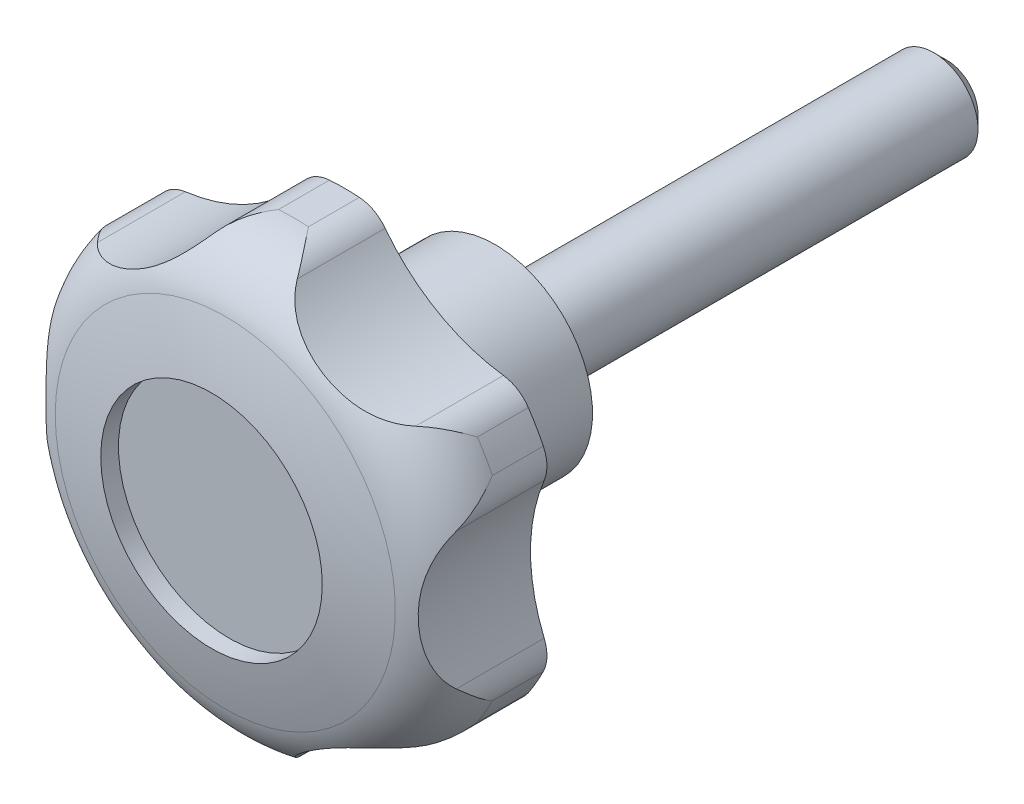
ISO-10303-21;
HEADER;
FILE_DESCRIPTION(('STEP AP214'),'2;1');
FILE_NAME('part.step','',(''),(''),'','','');
FILE_SCHEMA(('AUTOMOTIVE_DESIGN { 1 0 10303 214 1 1 1 1 }'));
ENDSEC;
DATA;
#1=APPLICATION_CONTEXT('core data for automotive mechanical design processes');
#2=APPLICATION_PROTOCOL_DEFINITION('international standard','automotive_design',2000,#1);
#3=PRODUCT_CONTEXT('',#1,'mechanical');
#4=PRODUCT('Part','Part','',(#3));
#5=PRODUCT_RELATED_PRODUCT_CATEGORY('part','',(#4));
#6=PRODUCT_DEFINITION_FORMATION('','',#4);
#7=PRODUCT_DEFINITION_CONTEXT('part definition',#1,'design');
#8=PRODUCT_DEFINITION('design','',#6,#7);
#9=PRODUCT_DEFINITION_SHAPE('','',#8);
#10=(LENGTH_UNIT() NAMED_UNIT(*) SI_UNIT(.MILLI.,.METRE.));
#11=(NAMED_UNIT(*) PLANE_ANGLE_UNIT() SI_UNIT($,.RADIAN.));
#12=(NAMED_UNIT(*) SI_UNIT($,.STERADIAN.) SOLID_ANGLE_UNIT());
#13=UNCERTAINTY_MEASURE_WITH_UNIT(LENGTH_MEASURE(1.E-05),#10,'distance_accuracy_value','');
#14=(GEOMETRIC_REPRESENTATION_CONTEXT(3) GLOBAL_UNCERTAINTY_ASSIGNED_CONTEXT((#13)) GLOBAL_UNIT_ASSIGNED_CONTEXT((#10,
#11,#12)) REPRESENTATION_CONTEXT('',''));
#15=CARTESIAN_POINT('',(0.,0.,0.));
#16=DIRECTION('',(0.,0.,1.));
#17=DIRECTION('',(1.,0.,0.));
#18=AXIS2_PLACEMENT_3D('',#15,#16,#17);
#19=CARTESIAN_POINT('',(0.,0.,46.4987648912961));
#20=DIRECTION('',(0.,0.,1.));
#21=DIRECTION('',(-1.,0.,0.));
#22=AXIS2_PLACEMENT_3D('',#19,#20,#21);
#23=CYLINDRICAL_SURFACE('',#22,25.);
#24=CARTESIAN_POINT('',(0.,0.,18.));
#25=DIRECTION('',(0.,0.,1.));
#26=DIRECTION('',(-1.,0.,0.));
#27=AXIS2_PLACEMENT_3D('',#24,#25,#26);
#28=CIRCLE('',#27,25.);
#29=CARTESIAN_POINT('',(22.4448315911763,11.010428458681,18.));
#30=VERTEX_POINT('',#29);
#31=CARTESIAN_POINT('',(20.7577265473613,13.9325801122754,18.));
#32=VERTEX_POINT('',#31);
#33=EDGE_CURVE('E440',#30,#32,#28,.T.);
#34=ORIENTED_EDGE('',*,*,#33,.T.);
#35=DIRECTION('',(0.,0.,1.));
#36=VECTOR('',#35,1.);
#37=CARTESIAN_POINT('',(20.7577265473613,13.9325801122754,-49.));
#38=LINE('',#37,#36);
#39=CARTESIAN_POINT('',(20.7577265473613,13.9325801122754,23.748934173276));
#40=VERTEX_POINT('',#39);
#41=EDGE_CURVE('E182',#32,#40,#38,.T.);
#42=ORIENTED_EDGE('',*,*,#41,.T.);
#43=CARTESIAN_POINT('',(0.,0.,23.748934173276));
#44=DIRECTION('',(0.,0.,1.));
#45=DIRECTION('',(-1.,0.,0.));
#46=AXIS2_PLACEMENT_3D('',#43,#44,#45);
#47=CIRCLE('',#46,25.);
#48=CARTESIAN_POINT('',(22.4448315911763,11.010428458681,23.748934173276));
#49=VERTEX_POINT('',#48);
#50=EDGE_CURVE('E198',#49,#40,#47,.T.);
#51=ORIENTED_EDGE('',*,*,#50,.F.);
#52=DIRECTION('',(0.,0.,1.));
#53=VECTOR('',#52,1.);
#54=CARTESIAN_POINT('',(22.4448315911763,11.010428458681,-49.));
#55=LINE('',#54,#53);
#56=EDGE_CURVE('E615',#30,#49,#55,.T.);
#57=ORIENTED_EDGE('',*,*,#56,.F.);
#58=EDGE_LOOP('',(#34,#42,#51,#57));
#59=FACE_BOUND('',#58,.T.);
#60=ADVANCED_FACE('F14',(#59),#23,.T.);
#61=CARTESIAN_POINT('',(20.7577265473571,-13.9325801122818,18.));
#62=VERTEX_POINT('',#61);
#63=CARTESIAN_POINT('',(22.444831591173,-11.010428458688,18.));
#64=VERTEX_POINT('',#63);
#65=EDGE_CURVE('E441',#62,#64,#28,.T.);
#66=ORIENTED_EDGE('',*,*,#65,.T.);
#67=DIRECTION('',(0.,0.,1.));
#68=VECTOR('',#67,1.);
#69=CARTESIAN_POINT('',(22.444831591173,-11.010428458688,-49.));
#70=LINE('',#69,#68);
#71=CARTESIAN_POINT('',(22.444831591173,-11.010428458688,23.748934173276));
#72=VERTEX_POINT('',#71);
#73=EDGE_CURVE('E607',#64,#72,#70,.T.);
#74=ORIENTED_EDGE('',*,*,#73,.T.);
#75=CARTESIAN_POINT('',(20.7577265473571,-13.9325801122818,23.748934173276));
#76=VERTEX_POINT('',#75);
#77=EDGE_CURVE('E622',#76,#72,#47,.T.);
#78=ORIENTED_EDGE('',*,*,#77,.F.);
#79=DIRECTION('',(0.,0.,1.));
#80=VECTOR('',#79,1.);
#81=CARTESIAN_POINT('',(20.7577265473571,-13.9325801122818,-49.));
#82=LINE('',#81,#80);
#83=EDGE_CURVE('E605',#62,#76,#82,.T.);
#84=ORIENTED_EDGE('',*,*,#83,.F.);
#85=EDGE_LOOP('',(#66,#74,#78,#84));
#86=FACE_BOUND('',#85,.T.);
#87=ADVANCED_FACE('F404',(#86),#23,.T.);
#88=CARTESIAN_POINT('',(-1.68710504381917,-24.943008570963,18.));
#89=VERTEX_POINT('',#88);
#90=CARTESIAN_POINT('',(1.68710504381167,-24.9430085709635,18.));
#91=VERTEX_POINT('',#90);
#92=EDGE_CURVE('E447',#89,#91,#28,.T.);
#93=ORIENTED_EDGE('',*,*,#92,.T.);
#94=DIRECTION('',(0.,0.,1.));
#95=VECTOR('',#94,1.);
#96=CARTESIAN_POINT('',(1.68710504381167,-24.9430085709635,-49.));
#97=LINE('',#96,#95);
#98=CARTESIAN_POINT('',(1.68710504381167,-24.9430085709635,23.748934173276));
#99=VERTEX_POINT('',#98);
#100=EDGE_CURVE('E596',#91,#99,#97,.T.);
#101=ORIENTED_EDGE('',*,*,#100,.T.);
#102=CARTESIAN_POINT('',(-1.68710504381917,-24.943008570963,23.748934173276));
#103=VERTEX_POINT('',#102);
#104=EDGE_CURVE('E452',#103,#99,#47,.T.);
#105=ORIENTED_EDGE('',*,*,#104,.F.);
#106=DIRECTION('',(0.,0.,1.));
#107=VECTOR('',#106,1.);
#108=CARTESIAN_POINT('',(-1.68710504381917,-24.943008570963,-49.));
#109=LINE('',#108,#107);
#110=EDGE_CURVE('E594',#89,#103,#109,.T.);
#111=ORIENTED_EDGE('',*,*,#110,.F.);
#112=EDGE_LOOP('',(#93,#101,#105,#111));
#113=FACE_BOUND('',#112,.T.);
#114=ADVANCED_FACE('F412',(#113),#23,.T.);
#115=CARTESIAN_POINT('',(-22.4448315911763,-11.0104284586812,18.));
#116=VERTEX_POINT('',#115);
#117=CARTESIAN_POINT('',(-20.7577265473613,-13.9325801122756,18.));
#118=VERTEX_POINT('',#117);
#119=EDGE_CURVE('E443',#116,#118,#28,.T.);
#120=ORIENTED_EDGE('',*,*,#119,.T.);
#121=DIRECTION('',(0.,0.,1.));
#122=VECTOR('',#121,1.);
#123=CARTESIAN_POINT('',(-20.7577265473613,-13.9325801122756,-49.));
#124=LINE('',#123,#122);
#125=CARTESIAN_POINT('',(-20.7577265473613,-13.9325801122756,23.748934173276));
#126=VERTEX_POINT('',#125);
#127=EDGE_CURVE('E585',#118,#126,#124,.T.);
#128=ORIENTED_EDGE('',*,*,#127,.T.);
#129=CARTESIAN_POINT('',(-22.4448315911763,-11.0104284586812,23.748934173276));
#130=VERTEX_POINT('',#129);
#131=EDGE_CURVE('E448',#130,#126,#47,.T.);
#132=ORIENTED_EDGE('',*,*,#131,.F.);
#133=DIRECTION('',(0.,0.,1.));
#134=VECTOR('',#133,1.);
#135=CARTESIAN_POINT('',(-22.4448315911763,-11.0104284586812,-49.));
#136=LINE('',#135,#134);
#137=EDGE_CURVE('E583',#116,#130,#136,.T.);
#138=ORIENTED_EDGE('',*,*,#137,.F.);
#139=EDGE_LOOP('',(#120,#128,#132,#138));
#140=FACE_BOUND('',#139,.T.);
#141=ADVANCED_FACE('F427',(#140),#23,.T.);
#142=CARTESIAN_POINT('',(-20.7577265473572,13.9325801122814,18.));
#143=VERTEX_POINT('',#142);
#144=CARTESIAN_POINT('',(-22.444831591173,11.0104284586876,18.));
#145=VERTEX_POINT('',#144);
#146=EDGE_CURVE('E203',#143,#145,#28,.T.);
#147=ORIENTED_EDGE('',*,*,#146,.T.);
#148=DIRECTION('',(0.,0.,1.));
#149=VECTOR('',#148,1.);
#150=CARTESIAN_POINT('',(-22.444831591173,11.0104284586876,-49.));
#151=LINE('',#150,#149);
#152=CARTESIAN_POINT('',(-22.444831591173,11.0104284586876,23.748934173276));
#153=VERTEX_POINT('',#152);
#154=EDGE_CURVE('E37',#145,#153,#151,.T.);
#155=ORIENTED_EDGE('',*,*,#154,.T.);
#156=CARTESIAN_POINT('',(-20.7577265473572,13.9325801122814,23.748934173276));
#157=VERTEX_POINT('',#156);
#158=EDGE_CURVE('E446',#157,#153,#47,.T.);
#159=ORIENTED_EDGE('',*,*,#158,.F.);
#160=DIRECTION('',(0.,0.,1.));
#161=VECTOR('',#160,1.);
#162=CARTESIAN_POINT('',(-20.7577265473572,13.9325801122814,-49.));
#163=LINE('',#162,#161);
#164=EDGE_CURVE('E574',#143,#157,#163,.T.);
#165=ORIENTED_EDGE('',*,*,#164,.F.);
#166=EDGE_LOOP('',(#147,#155,#159,#165));
#167=FACE_BOUND('',#166,.T.);
#168=ADVANCED_FACE('F417',(#167),#23,.T.);
#169=CARTESIAN_POINT('',(1.68710504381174,24.943008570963,18.));
#170=VERTEX_POINT('',#169);
#171=CARTESIAN_POINT('',(-1.68710504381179,24.943008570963,18.));
#172=VERTEX_POINT('',#171);
#173=EDGE_CURVE('E433',#170,#172,#28,.T.);
#174=ORIENTED_EDGE('',*,*,#173,.T.);
#175=DIRECTION('',(0.,0.,1.));
#176=VECTOR('',#175,1.);
#177=CARTESIAN_POINT('',(-1.6871050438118,24.943008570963,-49.));
#178=LINE('',#177,#176);
#179=CARTESIAN_POINT('',(-1.6871050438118,24.943008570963,23.748934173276));
#180=VERTEX_POINT('',#179);
#181=EDGE_CURVE('E435',#172,#180,#178,.T.);
#182=ORIENTED_EDGE('',*,*,#181,.T.);
#183=CARTESIAN_POINT('',(1.68710504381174,24.943008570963,23.748934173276));
#184=VERTEX_POINT('',#183);
#185=EDGE_CURVE('E621',#184,#180,#47,.T.);
#186=ORIENTED_EDGE('',*,*,#185,.F.);
#187=DIRECTION('',(0.,0.,1.));
#188=VECTOR('',#187,1.);
#189=CARTESIAN_POINT('',(1.68710504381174,24.943008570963,-49.));
#190=LINE('',#189,#188);
#191=EDGE_CURVE('E437',#170,#184,#190,.T.);
#192=ORIENTED_EDGE('',*,*,#191,.F.);
#193=EDGE_LOOP('',(#174,#182,#186,#192));
#194=FACE_BOUND('',#193,.T.);
#195=ADVANCED_FACE('F406',(#194),#23,.T.);
#196=CARTESIAN_POINT('',(0.,0.,46.4987648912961));
#197=DIRECTION('',(0.,0.,1.));
#198=DIRECTION('',(-1.,0.,0.));
#199=AXIS2_PLACEMENT_3D('',#196,#197,#198);
#200=CYLINDRICAL_SURFACE('',#199,11.);
#201=CARTESIAN_POINT('',(0.,0.,1.));
#202=DIRECTION('',(0.,0.,1.));
#203=DIRECTION('',(-1.,0.,0.));
#204=AXIS2_PLACEMENT_3D('',#201,#202,#203);
#205=CIRCLE('',#204,11.);
#206=CARTESIAN_POINT('',(-11.,0.,1.));
#207=VERTEX_POINT('',#206);
#208=EDGE_CURVE('E464',#207,#207,#205,.T.);
#209=ORIENTED_EDGE('',*,*,#208,.T.);
#210=EDGE_LOOP('',(#209));
#211=FACE_BOUND('',#210,.T.);
#212=CARTESIAN_POINT('',(0.,0.,18.));
#213=DIRECTION('',(0.,0.,1.));
#214=DIRECTION('',(-1.,0.,0.));
#215=AXIS2_PLACEMENT_3D('',#212,#213,#214);
#216=CIRCLE('',#215,11.);
#217=CARTESIAN_POINT('',(-11.,0.,18.));
#218=VERTEX_POINT('',#217);
#219=EDGE_CURVE('E199',#218,#218,#216,.T.);
#220=ORIENTED_EDGE('',*,*,#219,.F.);
#221=EDGE_LOOP('',(#220));
#222=FACE_BOUND('',#221,.T.);
#223=ADVANCED_FACE('F416',(#211,#222),#200,.T.);
#224=CARTESIAN_POINT('',(0.,11.,1.));
#225=DIRECTION('',(0.,0.,-1.));
#226=DIRECTION('',(1.,0.,0.));
#227=AXIS2_PLACEMENT_3D('',#224,#225,#226);
#228=PLANE('',#227);
#229=CARTESIAN_POINT('',(0.,0.,1.));
#230=DIRECTION('',(0.,0.,1.));
#231=DIRECTION('',(-1.,0.,0.));
#232=AXIS2_PLACEMENT_3D('',#229,#230,#231);
#233=CIRCLE('',#232,7.00000000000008);
#234=CARTESIAN_POINT('',(-7.00000000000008,0.,1.));
#235=VERTEX_POINT('',#234);
#236=EDGE_CURVE('E461',#235,#235,#233,.T.);
#237=ORIENTED_EDGE('',*,*,#236,.T.);
#238=EDGE_LOOP('',(#237));
#239=FACE_BOUND('',#238,.T.);
#240=ORIENTED_EDGE('',*,*,#208,.F.);
#241=EDGE_LOOP('',(#240));
#242=FACE_BOUND('',#241,.T.);
#243=ADVANCED_FACE('F424',(#239,#242),#228,.T.);
#244=CARTESIAN_POINT('',(0.,0.,46.4987648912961));
#245=DIRECTION('',(0.,0.,1.));
#246=DIRECTION('',(-1.,0.,0.));
#247=AXIS2_PLACEMENT_3D('',#244,#245,#246);
#248=CYLINDRICAL_SURFACE('',#247,7.00000000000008);
#249=CARTESIAN_POINT('',(0.,0.,0.));
#250=DIRECTION('',(0.,0.,1.));
#251=DIRECTION('',(-1.,0.,0.));
#252=AXIS2_PLACEMENT_3D('',#249,#250,#251);
#253=CIRCLE('',#252,7.00000000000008);
#254=CARTESIAN_POINT('',(-7.00000000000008,0.,0.));
#255=VERTEX_POINT('',#254);
#256=EDGE_CURVE('E458',#255,#255,#253,.T.);
#257=ORIENTED_EDGE('',*,*,#256,.T.);
#258=EDGE_LOOP('',(#257));
#259=FACE_BOUND('',#258,.T.);
#260=ORIENTED_EDGE('',*,*,#236,.F.);
#261=EDGE_LOOP('',(#260));
#262=FACE_BOUND('',#261,.T.);
#263=ADVANCED_FACE('F880',(#259,#262),#248,.T.);
#264=CARTESIAN_POINT('',(0.,3.88317009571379,0.));
#265=DIRECTION('',(0.,0.,1.));
#266=DIRECTION('',(-1.,0.,0.));
#267=AXIS2_PLACEMENT_3D('',#264,#265,#266);
#268=PLANE('',#267);
#269=CARTESIAN_POINT('',(0.,0.,0.));
#270=DIRECTION('',(0.,0.,1.));
#271=DIRECTION('',(1.,0.,0.));
#272=AXIS2_PLACEMENT_3D('',#269,#270,#271);
#273=CIRCLE('',#272,4.65);
#274=CARTESIAN_POINT('',(4.65,0.,0.));
#275=VERTEX_POINT('',#274);
#276=EDGE_CURVE('E516',#275,#275,#273,.T.);
#277=ORIENTED_EDGE('',*,*,#276,.T.);
#278=EDGE_LOOP('',(#277));
#279=FACE_BOUND('',#278,.T.);
#280=ORIENTED_EDGE('',*,*,#256,.F.);
#281=EDGE_LOOP('',(#280));
#282=FACE_BOUND('',#281,.T.);
#283=ADVANCED_FACE('F890',(#279,#282),#268,.F.);
#284=CARTESIAN_POINT('',(0.,0.,-35.8748865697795));
#285=DIRECTION('',(-1.,0.,0.));
#286=DIRECTION('',(0.,0.,-1.));
#287=AXIS2_PLACEMENT_3D('',#284,#285,#286);
#288=SPHERICAL_SURFACE('',#287,70.);
#289=CARTESIAN_POINT('',(0.,0.,-35.8748865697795));
#290=DIRECTION('',(0.,0.,1.));
#291=DIRECTION('',(-1.,0.,0.));
#292=AXIS2_PLACEMENT_3D('',#289,#290,#291);
#293=SPHERICAL_SURFACE('',#292,70.);
#294=CARTESIAN_POINT('',(0.,0.,31.4423303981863));
#295=DIRECTION('',(0.,0.,1.));
#296=DIRECTION('',(-1.,0.,0.));
#297=AXIS2_PLACEMENT_3D('',#294,#295,#296);
#298=CIRCLE('',#297,19.1935483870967);
#299=CARTESIAN_POINT('',(-19.1935483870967,0.,31.4423303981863));
#300=VERTEX_POINT('',#299);
#301=EDGE_CURVE('E451',#300,#300,#298,.T.);
#302=ORIENTED_EDGE('',*,*,#301,.T.);
#303=EDGE_LOOP('',(#302));
#304=FACE_BOUND('',#303,.T.);
#305=CARTESIAN_POINT('',(0.,0.,33.));
#306=DIRECTION('',(0.,0.,-1.));
#307=DIRECTION('',(1.,0.,0.));
#308=AXIS2_PLACEMENT_3D('',#305,#306,#307);
#309=CIRCLE('',#308,12.5);
#310=CARTESIAN_POINT('',(12.5,0.,33.));
#311=VERTEX_POINT('',#310);
#312=EDGE_CURVE('E560',#311,#311,#309,.T.);
#313=ORIENTED_EDGE('',*,*,#312,.T.);
#314=EDGE_LOOP('',(#313));
#315=FACE_BOUND('',#314,.T.);
#316=ADVANCED_FACE('F900',(#304,#315),#293,.T.);
#317=CARTESIAN_POINT('',(0.,0.,23.748934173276));
#318=DIRECTION('',(0.,0.,1.));
#319=DIRECTION('',(-1.,0.,0.));
#320=AXIS2_PLACEMENT_3D('',#317,#318,#319);
#321=TOROIDAL_SURFACE('',#320,17.,8.);
#322=CARTESIAN_POINT('',(22.444831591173,11.0104284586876,23.748934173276));
#323=CARTESIAN_POINT('',(22.4464357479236,11.0071583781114,23.7536552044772));
#324=CARTESIAN_POINT('',(22.4480354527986,11.0038860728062,23.7583762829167));
#325=CARTESIAN_POINT('',(22.5292989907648,10.8370787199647,23.9988749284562));
#326=CARTESIAN_POINT('',(22.5978518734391,10.6680207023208,24.2347597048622));
#327=CARTESIAN_POINT('',(22.7115523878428,10.3211392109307,24.7057756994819));
#328=CARTESIAN_POINT('',(22.7566913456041,10.1433125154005,24.9409066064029));
#329=CARTESIAN_POINT('',(22.8223990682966,9.78080623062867,25.4099624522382));
#330=CARTESIAN_POINT('',(22.8429294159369,9.59611638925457,25.6438849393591));
#331=CARTESIAN_POINT('',(22.8579355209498,9.22263939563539,26.1090481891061));
#332=CARTESIAN_POINT('',(22.8524280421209,9.0338549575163,26.3402905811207));
#333=CARTESIAN_POINT('',(22.813821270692,8.65409842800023,26.7998440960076));
#334=CARTESIAN_POINT('',(22.7806472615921,8.46312179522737,27.0281455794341));
#335=CARTESIAN_POINT('',(22.7089141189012,8.17797071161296,27.366534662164));
#336=CARTESIAN_POINT('',(22.6813764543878,8.08322589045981,27.4785526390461));
#337=CARTESIAN_POINT('',(22.6187377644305,7.89448609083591,27.7011813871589));
#338=CARTESIAN_POINT('',(22.583633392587,7.80049146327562,27.8117915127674));
#339=CARTESIAN_POINT('',(22.5446319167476,7.70709992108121,27.9215846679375));
#340=B_SPLINE_CURVE_WITH_KNOTS('',3,(#322,#323,#324,#325,#326,#327,#328,#329,#330,#331,#332,
#333,#334,#335,#336,#337,#338,#339),.UNSPECIFIED.,.F.,.F.,(4,2,2,2,2,2,2,2,4),(0.,
0.0178885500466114,0.911260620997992,1.80496341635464,2.70005959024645,3.59457955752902,
4.49152312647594,4.93917199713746,5.38701924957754),.UNSPECIFIED.);
#341=CARTESIAN_POINT('',(22.5447154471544,7.7072999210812,27.9213495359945));
#342=VERTEX_POINT('',#341);
#343=EDGE_CURVE('E200',#49,#342,#340,.T.);
#344=ORIENTED_EDGE('',*,*,#343,.F.);
#345=ORIENTED_EDGE('',*,*,#50,.T.);
#346=CARTESIAN_POINT('',(17.9468752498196,15.670672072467,27.921568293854));
#347=CARTESIAN_POINT('',(18.117798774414,15.648643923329,27.7346266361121));
#348=CARTESIAN_POINT('',(18.2845665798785,15.6160053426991,27.5453205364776));
#349=CARTESIAN_POINT('',(18.6084954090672,15.5314831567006,27.1630391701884));
#350=CARTESIAN_POINT('',(18.765663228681,15.4796133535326,26.9700666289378));
#351=CARTESIAN_POINT('',(19.0689959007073,15.3587065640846,26.5816885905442));
#352=CARTESIAN_POINT('',(19.215185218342,15.289709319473,26.386289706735));
#353=CARTESIAN_POINT('',(19.4960047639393,15.1361526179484,25.9933429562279));
#354=CARTESIAN_POINT('',(19.6306344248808,15.0515923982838,25.7957949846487));
#355=CARTESIAN_POINT('',(19.9555959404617,14.8198368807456,25.2939411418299));
#356=CARTESIAN_POINT('',(20.1376177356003,14.6632025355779,24.9885622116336));
#357=CARTESIAN_POINT('',(20.4694412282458,14.3220932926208,24.3764105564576));
#358=CARTESIAN_POINT('',(20.6192843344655,14.1376547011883,24.0696401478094));
#359=CARTESIAN_POINT('',(20.7536626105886,13.9386259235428,23.7583762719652));
#360=CARTESIAN_POINT('',(20.7556966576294,13.9356043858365,23.7536551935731));
#361=CARTESIAN_POINT('',(20.7577265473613,13.9325801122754,23.748934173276));
#362=B_SPLINE_CURVE_WITH_KNOTS('',3,(#346,#347,#348,#349,#350,#351,#352,#353,#354,#355,#356,
#357,#358,#359,#360,#361),.UNSPECIFIED.,.F.,.F.,(4,2,2,2,2,2,2,4),(0.,0.762311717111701,
1.52407738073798,2.28409173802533,3.04414335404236,4.20715114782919,5.36865325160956,
5.38654180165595),.UNSPECIFIED.);
#363=CARTESIAN_POINT('',(17.9470752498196,15.6706463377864,27.9213495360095));
#364=VERTEX_POINT('',#363);
#365=EDGE_CURVE('E186',#364,#40,#362,.T.);
#366=ORIENTED_EDGE('',*,*,#365,.F.);
#367=CARTESIAN_POINT('',(17.9472752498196,15.670620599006,27.921130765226));
#368=CARTESIAN_POINT('',(17.8000960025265,15.6895370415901,28.0822346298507));
#369=CARTESIAN_POINT('',(17.6451448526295,15.7111642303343,28.2357655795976));
#370=CARTESIAN_POINT('',(17.3223674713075,15.7604215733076,28.5271060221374));
#371=CARTESIAN_POINT('',(17.1545598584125,15.788043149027,28.6649375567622));
#372=CARTESIAN_POINT('',(16.8102495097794,15.8495736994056,28.923305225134));
#373=CARTESIAN_POINT('',(16.6338655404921,15.8834086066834,29.044018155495));
#374=CARTESIAN_POINT('',(16.2729388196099,15.9579775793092,29.2702246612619));
#375=CARTESIAN_POINT('',(16.08839350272,15.9987138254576,29.3757134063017));
#376=CARTESIAN_POINT('',(15.7143264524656,16.0871013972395,29.5714668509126));
#377=CARTESIAN_POINT('',(15.5248361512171,16.1347150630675,29.661809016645));
#378=CARTESIAN_POINT('',(15.1418469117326,16.2371300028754,29.8287610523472));
#379=CARTESIAN_POINT('',(14.9483483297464,16.2919306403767,29.9053721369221));
#380=CARTESIAN_POINT('',(14.558355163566,16.4089153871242,30.0460657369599));
#381=CARTESIAN_POINT('',(14.3618533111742,16.4711212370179,30.1101098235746));
#382=CARTESIAN_POINT('',(13.9677629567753,16.6027276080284,30.2264374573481));
#383=CARTESIAN_POINT('',(13.7701742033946,16.6721298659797,30.2787181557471));
#384=CARTESIAN_POINT('',(13.2568720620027,16.8616609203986,30.4006076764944));
#385=CARTESIAN_POINT('',(12.941186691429,16.9873034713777,30.4618798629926));
#386=CARTESIAN_POINT('',(12.313507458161,17.2560665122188,30.5606509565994));
#387=CARTESIAN_POINT('',(12.0015155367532,17.3991957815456,30.5981378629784));
#388=CARTESIAN_POINT('',(11.3830678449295,17.7025343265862,30.6519278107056));
#389=CARTESIAN_POINT('',(11.0766289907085,17.8627879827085,30.6681742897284));
#390=CARTESIAN_POINT('',(10.4722361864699,18.1991370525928,30.6804878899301));
#391=CARTESIAN_POINT('',(10.1742808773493,18.3752299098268,30.6765582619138));
#392=CARTESIAN_POINT('',(9.58255501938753,18.7459626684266,30.6479465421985));
#393=CARTESIAN_POINT('',(9.28899683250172,18.9409097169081,30.6228389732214));
#394=CARTESIAN_POINT('',(8.71439077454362,19.3446564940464,30.5494207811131));
#395=CARTESIAN_POINT('',(8.43334617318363,19.5534598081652,30.5011041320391));
#396=CARTESIAN_POINT('',(7.88706048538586,19.9817784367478,30.3782042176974));
#397=CARTESIAN_POINT('',(7.62176755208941,20.2012537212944,30.3037134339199));
#398=CARTESIAN_POINT('',(7.10876905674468,20.6480271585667,30.1242106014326));
#399=CARTESIAN_POINT('',(6.86104855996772,20.8753184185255,30.019224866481));
#400=CARTESIAN_POINT('',(6.48058176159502,21.2418536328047,29.8228937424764));
#401=CARTESIAN_POINT('',(6.34121880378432,21.3802460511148,29.7426671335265));
#402=CARTESIAN_POINT('',(6.07081213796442,21.656560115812,29.5685988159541));
#403=CARTESIAN_POINT('',(5.93976564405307,21.7944819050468,29.4747617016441));
#404=CARTESIAN_POINT('',(5.68708094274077,22.0678451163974,29.272998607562));
#405=CARTESIAN_POINT('',(5.56542019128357,22.2032918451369,29.1651081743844));
#406=CARTESIAN_POINT('',(5.33197442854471,22.4700784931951,28.9346793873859));
#407=CARTESIAN_POINT('',(5.22018481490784,22.6014203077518,28.8121479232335));
#408=CARTESIAN_POINT('',(5.01910520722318,22.8435588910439,28.5669102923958));
#409=CARTESIAN_POINT('',(4.92869795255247,22.9550077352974,28.4457651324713));
#410=CARTESIAN_POINT('',(4.75649074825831,23.1716770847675,28.1919642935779));
#411=CARTESIAN_POINT('',(4.67470230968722,23.2768891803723,28.0592936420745));
#412=CARTESIAN_POINT('',(4.59748765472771,23.3781462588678,27.92107664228));
#413=B_SPLINE_CURVE_WITH_KNOTS('',3,(#367,#368,#369,#370,#371,#372,#373,#374,#375,#376,#377,
#378,#379,#380,#381,#382,#383,#384,#385,#386,#387,#388,#389,#390,#391,#392,#393,#394,#395,#396,
#397,#398,#399,#400,#401,#402,#403,#404,#405,#406,#407,#408,#409,#410,#411,#412),.UNSPECIFIED.,
.F.,.F.,(4,2,2,2,2,2,2,2,2,2,2,2,2,2,2,2,2,2,2,2,2,2,4),(0.,0.656644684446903,1.31235577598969,
1.96070546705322,2.60926041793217,3.25438989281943,3.89946227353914,4.54647750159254,
5.19364925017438,6.22787361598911,7.26261937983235,8.30011505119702,9.33744356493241,
10.3961231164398,11.4550776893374,12.5103276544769,13.5646697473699,14.2006301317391,
14.8363763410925,15.4705446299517,16.1044156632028,16.6671921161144,17.2307109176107),.UNSPECIFIED.);
#414=CARTESIAN_POINT('',(4.59764019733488,23.3779462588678,27.921349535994));
#415=VERTEX_POINT('',#414);
#416=EDGE_CURVE('E174',#364,#415,#413,.T.);
#417=ORIENTED_EDGE('',*,*,#416,.T.);
#418=CARTESIAN_POINT('',(1.68710504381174,24.943008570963,23.748934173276));
#419=CARTESIAN_POINT('',(1.69073909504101,24.9427627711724,23.7536552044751));
#420=CARTESIAN_POINT('',(1.69437284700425,24.94251200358,23.7583762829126));
#421=CARTESIAN_POINT('',(1.87946401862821,24.9294846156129,23.998874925));
#422=CARTESIAN_POINT('',(2.06014899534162,24.9043241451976,24.2347596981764));
#423=CARTESIAN_POINT('',(2.41740743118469,24.8293509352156,24.7057756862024));
#424=CARTESIAN_POINT('',(2.59397934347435,24.7795290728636,24.9409065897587));
#425=CARTESIAN_POINT('',(2.94077285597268,24.6551804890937,25.4099624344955));
#426=CARTESIAN_POINT('',(3.11098412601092,24.5806153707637,25.6438849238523));
#427=CARTESIAN_POINT('',(3.4419277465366,24.406872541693,26.1090481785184));
#428=CARTESIAN_POINT('',(3.60266612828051,24.3077107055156,26.3402905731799));
#429=CARTESIAN_POINT('',(3.91224597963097,24.0843947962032,26.7998506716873));
#430=CARTESIAN_POINT('',(4.06105367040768,23.9601730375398,27.0281586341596));
#431=CARTESIAN_POINT('',(4.27214053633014,23.7554678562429,27.36655718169));
#432=CARTESIAN_POINT('',(4.34042478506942,23.6842446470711,27.4785782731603));
#433=CARTESIAN_POINT('',(4.47256192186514,23.5356227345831,27.7012131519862));
#434=CARTESIAN_POINT('',(4.53641283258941,23.4582213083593,27.8118262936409));
#435=CARTESIAN_POINT('',(4.59779273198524,23.3777462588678,27.9216224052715));
#436=B_SPLINE_CURVE_WITH_KNOTS('',3,(#418,#419,#420,#421,#422,#423,#424,#425,#426,#427,#428,
#429,#430,#431,#432,#433,#434,#435),.UNSPECIFIED.,.F.,.F.,(4,2,2,2,2,2,2,2,4),(0.,
0.0178885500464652,0.911260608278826,1.80496339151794,2.70005957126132,3.59457955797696,
4.49154874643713,4.93921044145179,5.38707053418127),.UNSPECIFIED.);
#437=EDGE_CURVE('E181',#184,#415,#436,.T.);
#438=ORIENTED_EDGE('',*,*,#437,.F.);
#439=ORIENTED_EDGE('',*,*,#185,.T.);
#440=CARTESIAN_POINT('',(-4.5977927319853,23.3777462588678,27.9216224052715));
#441=CARTESIAN_POINT('',(-4.493256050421,23.514757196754,27.7346823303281));
#442=CARTESIAN_POINT('',(-4.38160827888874,23.6428640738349,27.5453777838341));
#443=CARTESIAN_POINT('',(-4.14644934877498,23.8811358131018,27.1630994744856));
#444=CARTESIAN_POINT('',(-4.02294674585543,23.9913134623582,26.9701284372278));
#445=CARTESIAN_POINT('',(-3.76657567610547,24.1935565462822,26.5817533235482));
#446=CARTESIAN_POINT('',(-3.63372939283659,24.2856630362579,26.3863558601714));
#447=CARTESIAN_POINT('',(-3.36033897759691,24.4520846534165,25.993411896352));
#448=CARTESIAN_POINT('',(-3.21979446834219,24.5263989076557,25.7958652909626));
#449=CARTESIAN_POINT('',(-2.85660155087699,24.6919550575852,25.2940011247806));
#450=CARTESIAN_POINT('',(-2.62993299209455,24.7712789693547,24.9886102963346));
#451=CARTESIAN_POINT('',(-2.16859445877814,24.8880997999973,24.3764346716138));
#452=CARTESIAN_POINT('',(-1.93393522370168,24.9256507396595,24.0696521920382));
#453=CARTESIAN_POINT('',(-1.69437283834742,24.942512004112,23.7583762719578));
#454=CARTESIAN_POINT('',(-1.69073908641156,24.9427627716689,23.7536551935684));
#455=CARTESIAN_POINT('',(-1.68710504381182,24.943008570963,23.748934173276));
#456=B_SPLINE_CURVE_WITH_KNOTS('',3,(#440,#441,#442,#443,#444,#445,#446,#447,#448,#449,#450,
#451,#452,#453,#454,#455),.UNSPECIFIED.,.F.,.F.,(4,2,2,2,2,2,2,4),(0.,0.762307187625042,
1.52406829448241,2.284078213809,3.0441254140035,4.20717896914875,5.36872670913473,
5.38661525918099),.UNSPECIFIED.);
#457=CARTESIAN_POINT('',(-4.59764019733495,23.3779462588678,27.9213495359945));
#458=VERTEX_POINT('',#457);
#459=EDGE_CURVE('E249',#458,#180,#456,.T.);
#460=ORIENTED_EDGE('',*,*,#459,.F.);
#461=CARTESIAN_POINT('',(-4.59748765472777,23.3781462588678,27.92107664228));
#462=CARTESIAN_POINT('',(-4.68745740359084,23.260145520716,28.0821810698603));
#463=CARTESIAN_POINT('',(-4.78366062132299,23.1367694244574,28.2357127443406));
#464=CARTESIAN_POINT('',(-4.98770324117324,22.8818683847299,28.5270549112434));
#465=CARTESIAN_POINT('',(-5.09552590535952,22.7503552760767,28.6648874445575));
#466=CARTESIAN_POINT('',(-5.32096382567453,22.4829423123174,28.9232573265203));
#467=CARTESIAN_POINT('',(-5.43845555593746,22.3471082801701,29.0439714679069));
#468=CARTESIAN_POINT('',(-5.68349322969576,22.0718238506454,29.2701805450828));
#469=CARTESIAN_POINT('',(-5.81104234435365,21.9323723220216,29.3756706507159));
#470=CARTESIAN_POINT('',(-6.0746174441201,21.652616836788,29.5714269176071));
#471=CARTESIAN_POINT('',(-6.21059510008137,21.5123212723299,29.6617705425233));
#472=CARTESIAN_POINT('',(-6.49077939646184,21.2318521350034,29.8287255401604));
#473=CARTESIAN_POINT('',(-6.6349853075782,21.091678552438,29.9053381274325));
#474=CARTESIAN_POINT('',(-6.93128941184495,20.81242830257,30.046034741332));
#475=CARTESIAN_POINT('',(-7.08341006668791,20.6733562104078,30.1100803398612));
#476=CARTESIAN_POINT('',(-7.39442549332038,20.3978680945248,30.226410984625));
#477=CARTESIAN_POINT('',(-7.55332189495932,20.2614527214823,30.2786931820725));
#478=CARTESIAN_POINT('',(-7.97410593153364,19.9116865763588,30.4005864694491));
#479=CARTESIAN_POINT('',(-8.24075460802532,19.7011167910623,30.4618609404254));
#480=CARTESIAN_POINT('',(-8.78734257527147,19.2919126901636,30.5606366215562));
#481=CARTESIAN_POINT('',(-9.06728849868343,19.0932844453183,30.5981258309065));
#482=CARTESIAN_POINT('',(-9.63920400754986,18.7093620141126,30.6519204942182));
#483=CARTESIAN_POINT('',(-9.93120356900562,18.5241046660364,30.6681693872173));
#484=CARTESIAN_POINT('',(-10.5246796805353,18.1688586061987,30.6804880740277));
#485=CARTESIAN_POINT('',(-10.8261546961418,17.9988674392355,30.6765611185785));
#486=CARTESIAN_POINT('',(-11.4430750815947,17.6717820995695,30.6479552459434));
#487=CARTESIAN_POINT('',(-11.7586802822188,17.5150254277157,30.6228508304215));
#488=CARTESIAN_POINT('',(-12.3956325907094,17.2192723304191,30.5494396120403));
#489=CARTESIAN_POINT('',(-12.7169811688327,17.0802805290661,30.5011267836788));
#490=CARTESIAN_POINT('',(-13.3610540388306,16.8213387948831,30.3782353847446));
#491=CARTESIAN_POINT('',(-13.6837695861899,16.7013239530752,30.3037492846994));
#492=CARTESIAN_POINT('',(-14.3271826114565,16.4804364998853,30.1242568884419));
#493=CARTESIAN_POINT('',(-14.6478815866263,16.3795475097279,30.019276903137));
#494=CARTESIAN_POINT('',(-15.1555460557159,16.2333162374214,29.8229545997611));
#495=CARTESIAN_POINT('',(-15.3450819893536,16.1818181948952,29.7427304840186));
#496=CARTESIAN_POINT('',(-15.719586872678,16.0857915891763,29.5686670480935));
#497=CARTESIAN_POINT('',(-15.9045573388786,16.0412606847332,29.4748323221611));
#498=CARTESIAN_POINT('',(-16.2676463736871,15.959106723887,29.2730738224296));
#499=CARTESIAN_POINT('',(-16.4457808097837,15.9214667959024,29.1651855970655));
#500=CARTESIAN_POINT('',(-16.7935555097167,15.8526864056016,28.9347609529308));
#501=CARTESIAN_POINT('',(-16.9631997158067,15.8215429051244,28.8122314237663));
#502=CARTESIAN_POINT('',(-17.2734523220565,15.7684678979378,28.5669917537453));
#503=CARTESIAN_POINT('',(-17.4151836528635,15.7458950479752,28.4458421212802));
#504=CARTESIAN_POINT('',(-17.6889479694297,15.7050898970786,28.192030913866));
#505=CARTESIAN_POINT('',(-17.8209679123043,15.6868633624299,28.0593543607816));
#506=CARTESIAN_POINT('',(-17.9472752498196,15.670620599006,27.921130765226));
#507=B_SPLINE_CURVE_WITH_KNOTS('',3,(#461,#462,#463,#464,#465,#466,#467,#468,#469,#470,#471,
#472,#473,#474,#475,#476,#477,#478,#479,#480,#481,#482,#483,#484,#485,#486,#487,#488,#489,#490,
#491,#492,#493,#494,#495,#496,#497,#498,#499,#500,#501,#502,#503,#504,#505,#506),.UNSPECIFIED.,
.F.,.F.,(4,2,2,2,2,2,2,2,2,2,2,2,2,2,2,2,2,2,2,2,2,2,4),(0.,0.656640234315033,1.31234690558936,
1.9606922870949,2.60924292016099,3.25436818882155,3.89943636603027,4.54644734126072,
5.1936148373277,6.22783106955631,7.26256869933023,8.30005616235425,9.33737647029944,
10.3960491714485,11.4549968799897,12.5102403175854,13.5645759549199,14.2005435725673,
14.8362970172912,15.4704724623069,16.1043506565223,16.667159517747,17.2307109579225),.UNSPECIFIED.);
#508=CARTESIAN_POINT('',(-17.9470752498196,15.6706463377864,27.921349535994));
#509=VERTEX_POINT('',#508);
#510=EDGE_CURVE('E255',#458,#509,#507,.T.);
#511=ORIENTED_EDGE('',*,*,#510,.T.);
#512=CARTESIAN_POINT('',(-20.7577265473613,13.9325801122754,23.748934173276));
#513=CARTESIAN_POINT('',(-20.7556966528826,13.9356043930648,23.7536552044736));
#514=CARTESIAN_POINT('',(-20.7536626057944,13.9386259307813,23.7583762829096));
#515=CARTESIAN_POINT('',(-20.6498349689,14.0924058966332,23.9988749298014));
#516=CARTESIAN_POINT('',(-20.537702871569,14.2363034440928,24.2347597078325));
#517=CARTESIAN_POINT('',(-20.2941449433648,14.5082117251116,24.7057757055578));
#518=CARTESIAN_POINT('',(-20.1627119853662,14.6362165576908,24.9409066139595));
#519=CARTESIAN_POINT('',(-19.8816261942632,14.8743742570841,25.4099624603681));
#520=CARTESIAN_POINT('',(-19.7319452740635,14.9844989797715,25.6438849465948));
#521=CARTESIAN_POINT('',(-19.4160077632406,15.1842331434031,26.109048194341));
#522=CARTESIAN_POINT('',(-19.2497619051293,15.273855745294,26.3402905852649));
#523=CARTESIAN_POINT('',(-18.9015818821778,15.4302985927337,26.7998412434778));
#524=CARTESIAN_POINT('',(-18.719606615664,15.4970566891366,27.0281399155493));
#525=CARTESIAN_POINT('',(-18.4367957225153,15.5775089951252,27.3665248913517));
#526=CARTESIAN_POINT('',(-18.3409767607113,15.6010330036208,27.4785415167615));
#527=CARTESIAN_POINT('',(-18.1462066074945,15.6411562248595,27.7011676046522));
#528=CARTESIAN_POINT('',(-18.0472540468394,15.6577523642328,27.811776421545));
#529=CARTESIAN_POINT('',(-17.9468752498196,15.670672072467,27.9215682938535));
#530=B_SPLINE_CURVE_WITH_KNOTS('',3,(#512,#513,#514,#515,#516,#517,#518,#519,#520,#521,#522,
#523,#524,#525,#526,#527,#528,#529),.UNSPECIFIED.,.F.,.F.,(4,2,2,2,2,2,2,2,4),(0.,
0.0178885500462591,0.911260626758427,1.80496342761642,2.70005959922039,3.59457955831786,
4.49151201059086,4.93915531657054,5.38699699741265),.UNSPECIFIED.);
#531=EDGE_CURVE('E278',#157,#509,#530,.T.);
#532=ORIENTED_EDGE('',*,*,#531,.F.);
#533=ORIENTED_EDGE('',*,*,#158,.T.);
#534=CARTESIAN_POINT('',(-22.5446319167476,7.70709992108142,27.9215846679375));
#535=CARTESIAN_POINT('',(-22.6110172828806,7.86613771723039,27.7346434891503));
#536=CARTESIAN_POINT('',(-22.66613590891,8.02688180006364,27.5453378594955));
#537=CARTESIAN_POINT('',(-22.7549031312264,8.34967281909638,27.1630574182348));
#538=CARTESIAN_POINT('',(-22.7885670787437,8.51171873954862,26.9700853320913));
#539=CARTESIAN_POINT('',(-22.8355263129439,8.83486539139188,26.5817081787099));
#540=CARTESIAN_POINT('',(-22.8488682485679,8.99596743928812,26.3863097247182));
#541=CARTESIAN_POINT('',(-22.8562953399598,9.31594223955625,25.9933638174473));
#542=CARTESIAN_POINT('',(-22.8503795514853,9.47481488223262,25.7958162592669));
#543=CARTESIAN_POINT('',(-22.8121555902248,9.87212049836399,25.2939592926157));
#544=CARTESIAN_POINT('',(-22.7675173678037,10.1080762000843,24.9885767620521));
#545=CARTESIAN_POINT('',(-22.6380192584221,10.5660041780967,24.3764178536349));
#546=CARTESIAN_POINT('',(-22.5532115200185,10.7879941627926,24.0696437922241));
#547=CARTESIAN_POINT('',(-22.4480354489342,11.0038860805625,23.7583762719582));
#548=CARTESIAN_POINT('',(-22.4464357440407,11.0071583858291,23.7536551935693));
#549=CARTESIAN_POINT('',(-22.444831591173,11.0104284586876,23.748934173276));
#550=B_SPLINE_CURVE_WITH_KNOTS('',3,(#534,#535,#536,#537,#538,#539,#540,#541,#542,#543,#544,
#545,#546,#547,#548,#549),.UNSPECIFIED.,.F.,.F.,(4,2,2,2,2,2,2,4),(0.,0.762310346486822,
1.52407463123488,2.28408764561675,3.04413792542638,4.20715956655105,5.3686754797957,
5.386564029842),.UNSPECIFIED.);
#551=CARTESIAN_POINT('',(-22.5447154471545,7.70729992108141,27.9213495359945));
#552=VERTEX_POINT('',#551);
#553=EDGE_CURVE('E284',#552,#153,#550,.T.);
#554=ORIENTED_EDGE('',*,*,#553,.F.);
#555=CARTESIAN_POINT('',(-22.5447989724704,7.70749992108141,27.921114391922));
#556=CARTESIAN_POINT('',(-22.4875916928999,7.57058155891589,28.0822184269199));
#557=CARTESIAN_POINT('',(-22.428846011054,7.42557716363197,28.2357495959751));
#558=CARTESIAN_POINT('',(-22.3101157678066,7.12141673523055,28.5270905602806));
#559=CARTESIAN_POINT('',(-22.2501330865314,6.96228111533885,28.6649223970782));
#560=CARTESIAN_POINT('',(-22.1312651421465,6.63333594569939,28.9232907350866));
#561=CARTESIAN_POINT('',(-22.0723751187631,6.4636662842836,29.0440040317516));
#562=CARTESIAN_POINT('',(-21.9564904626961,6.11381164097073,29.2702113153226));
#563=CARTESIAN_POINT('',(-21.899496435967,5.93362334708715,29.3757004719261));
#564=CARTESIAN_POINT('',(-21.789008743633,5.56547946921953,29.571454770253));
#565=CARTESIAN_POINT('',(-21.7354981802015,5.37756993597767,29.6617973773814));
#566=CARTESIAN_POINT('',(-21.6326973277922,4.99468544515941,29.8287503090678));
#567=CARTESIAN_POINT('',(-21.5834066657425,4.79971111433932,29.9053618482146));
#568=CARTESIAN_POINT('',(-21.4897215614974,4.40347606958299,30.0460563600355));
#569=CARTESIAN_POINT('',(-21.4453423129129,4.20219819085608,30.1101009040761));
#570=CARTESIAN_POINT('',(-21.362271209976,3.79510399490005,30.2264294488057));
#571=CARTESIAN_POINT('',(-21.3235807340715,3.589286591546,30.2787106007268));
#572=CARTESIAN_POINT('',(-21.2310677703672,3.04999002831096,30.4006012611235));
#573=CARTESIAN_POINT('',(-21.1820343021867,2.7137782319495,30.4618741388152));
#574=CARTESIAN_POINT('',(-21.1009493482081,2.03581253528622,30.5606466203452));
#575=CARTESIAN_POINT('',(-21.0689064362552,1.69405592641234,30.5981342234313));
#576=CARTESIAN_POINT('',(-21.0223803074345,1.00679709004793,30.6519255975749));
#577=CARTESIAN_POINT('',(-21.007943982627,0.661287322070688,30.6681728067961));
#578=CARTESIAN_POINT('',(-20.9970330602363,-0.0303050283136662,30.6804879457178));
#579=CARTESIAN_POINT('',(-21.0005555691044,-0.376387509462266,30.6765591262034));
#580=CARTESIAN_POINT('',(-21.0257550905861,-1.07420211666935,30.647949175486));
#581=CARTESIAN_POINT('',(-21.0478042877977,-1.42590390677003,30.6228425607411));
#582=CARTESIAN_POINT('',(-21.1101545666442,-2.12539970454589,30.549426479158));
#583=CARTESIAN_POINT('',(-21.1504603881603,-2.47319267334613,30.5011109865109));
#584=CARTESIAN_POINT('',(-21.2482506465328,-3.16044858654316,30.3782136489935));
#585=CARTESIAN_POINT('',(-21.3056744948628,-3.499936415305,30.3037242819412));
#586=CARTESIAN_POINT('',(-21.4360907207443,-4.16759265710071,30.1242246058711));
#587=CARTESIAN_POINT('',(-21.5090696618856,-4.4957705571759,30.0192406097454));
#588=CARTESIAN_POINT('',(-21.6362641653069,-5.00853364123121,29.8229120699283));
#589=CARTESIAN_POINT('',(-21.6864339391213,-5.19842309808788,29.7426861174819));
#590=CARTESIAN_POINT('',(-21.7905255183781,-5.57076198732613,29.568619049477));
#591=CARTESIAN_POINT('',(-21.8444460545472,-5.75321390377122,29.4747825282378));
#592=CARTESIAN_POINT('',(-21.9548433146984,-6.1087297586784,29.2730205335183));
#593=CARTESIAN_POINT('',(-22.0113133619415,-6.28181587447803,29.1651306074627));
#594=CARTESIAN_POINT('',(-22.1256348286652,-6.617382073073,28.9347027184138));
#595=CARTESIAN_POINT('',(-22.1834855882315,-6.7798670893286,28.8121716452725));
#596=CARTESIAN_POINT('',(-22.2926436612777,-7.07507705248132,28.5669363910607));
#597=CARTESIAN_POINT('',(-22.3439570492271,-7.20909576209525,28.4457934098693));
#598=CARTESIAN_POINT('',(-22.4454936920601,-7.46656518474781,28.1919971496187));
#599=CARTESIAN_POINT('',(-22.4957154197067,-7.59000172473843,28.0593288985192));
#600=CARTESIAN_POINT('',(-22.5447989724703,-7.70749992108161,27.9211143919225));
#601=B_SPLINE_CURVE_WITH_KNOTS('',3,(#555,#556,#557,#558,#559,#560,#561,#562,#563,#564,#565,
#566,#567,#568,#569,#570,#571,#572,#573,#574,#575,#576,#577,#578,#579,#580,#581,#582,#583,#584,
#585,#586,#587,#588,#589,#590,#591,#592,#593,#594,#595,#596,#597,#598,#599,#600),.UNSPECIFIED.,
.F.,.F.,(4,2,2,2,2,2,2,2,2,2,2,2,2,2,2,2,2,2,2,2,2,2,4),(0.,0.656643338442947,1.3123530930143,
1.96070148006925,2.60925512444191,3.25438332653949,3.89945443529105,4.54646837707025,
5.19363883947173,6.22786074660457,7.26260405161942,8.30009723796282,9.33742326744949,
10.3961007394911,11.4550532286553,12.5103012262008,13.5646413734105,14.2006046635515,
14.8363537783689,15.4705249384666,16.1043988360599,16.6671691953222,17.2306818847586),.UNSPECIFIED.);
#602=CARTESIAN_POINT('',(-22.5447154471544,-7.7072999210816,27.921349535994));
#603=VERTEX_POINT('',#602);
#604=EDGE_CURVE('E290',#552,#603,#601,.T.);
#605=ORIENTED_EDGE('',*,*,#604,.T.);
#606=CARTESIAN_POINT('',(-22.444831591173,-11.010428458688,23.748934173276));
#607=CARTESIAN_POINT('',(-22.4464357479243,-11.0071583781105,23.753655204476));
#608=CARTESIAN_POINT('',(-22.4480354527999,-11.003886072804,23.7583762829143));
#609=CARTESIAN_POINT('',(-22.5292989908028,-10.8370787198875,23.9988749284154));
#610=CARTESIAN_POINT('',(-22.5978518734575,-10.6680207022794,24.234759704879));
#611=CARTESIAN_POINT('',(-22.7115523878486,-10.3211392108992,24.7057756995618));
#612=CARTESIAN_POINT('',(-22.7566913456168,-10.143312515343,24.9409066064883));
#613=CARTESIAN_POINT('',(-22.8223990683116,-9.78080623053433,25.4099624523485));
#614=CARTESIAN_POINT('',(-22.8429294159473,-9.59611638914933,25.643884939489));
#615=CARTESIAN_POINT('',(-22.857935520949,-9.22263939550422,26.1090481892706));
#616=CARTESIAN_POINT('',(-22.8524280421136,-9.03385495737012,26.3402905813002));
#617=CARTESIAN_POINT('',(-22.8138212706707,-8.65409842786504,26.7998440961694));
#618=CARTESIAN_POINT('',(-22.780647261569,-8.46312179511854,27.0281455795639));
#619=CARTESIAN_POINT('',(-22.7089141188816,-8.17797071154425,27.3665346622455));
#620=CARTESIAN_POINT('',(-22.6813764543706,-8.08322589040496,27.478552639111));
#621=CARTESIAN_POINT('',(-22.6187377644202,-7.89448609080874,27.7011813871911));
#622=CARTESIAN_POINT('',(-22.5836333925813,-7.80049146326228,27.8117915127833));
#623=CARTESIAN_POINT('',(-22.5446319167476,-7.7070999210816,27.9215846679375));
#624=B_SPLINE_CURVE_WITH_KNOTS('',3,(#606,#607,#608,#609,#610,#611,#612,#613,#614,#615,#616,
#617,#618,#619,#620,#621,#622,#623),.UNSPECIFIED.,.F.,.F.,(4,2,2,2,2,2,2,2,4),(0.,
0.0178885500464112,0.911260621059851,1.80496341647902,2.70005959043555,3.59457955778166,
4.49152312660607,4.93917199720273,5.38701924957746),.UNSPECIFIED.);
#625=EDGE_CURVE('E297',#130,#603,#624,.T.);
#626=ORIENTED_EDGE('',*,*,#625,.F.);
#627=ORIENTED_EDGE('',*,*,#131,.T.);
#628=CARTESIAN_POINT('',(-17.9468752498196,-15.6706720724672,27.9215682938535));
#629=CARTESIAN_POINT('',(-18.1177987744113,-15.6486439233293,27.7346266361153));
#630=CARTESIAN_POINT('',(-18.2845665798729,-15.6160053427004,27.5453205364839));
#631=CARTESIAN_POINT('',(-18.6084954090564,-15.5314831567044,27.1630391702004));
#632=CARTESIAN_POINT('',(-18.765663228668,-15.4796133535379,26.9700666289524));
#633=CARTESIAN_POINT('',(-19.0689959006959,-15.3587065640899,26.5816885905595));
#634=CARTESIAN_POINT('',(-19.2151852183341,-15.2897093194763,26.3862897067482));
#635=CARTESIAN_POINT('',(-19.4960047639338,-15.1361526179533,25.9933429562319));
#636=CARTESIAN_POINT('',(-19.6306344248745,-15.0515923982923,25.7957949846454));
#637=CARTESIAN_POINT('',(-19.9555959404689,-14.8198368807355,25.2939411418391));
#638=CARTESIAN_POINT('',(-20.1376177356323,-14.6632025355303,24.9885622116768));
#639=CARTESIAN_POINT('',(-20.4694412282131,-14.3220932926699,24.3764105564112));
#640=CARTESIAN_POINT('',(-20.6192843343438,-14.1376547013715,24.0696401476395));
#641=CARTESIAN_POINT('',(-20.7536626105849,-13.9386259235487,23.7583762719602));
#642=CARTESIAN_POINT('',(-20.7556966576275,-13.9356043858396,23.7536551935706));
#643=CARTESIAN_POINT('',(-20.7577265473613,-13.9325801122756,23.748934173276));
#644=B_SPLINE_CURVE_WITH_KNOTS('',3,(#628,#629,#630,#631,#632,#633,#634,#635,#636,#637,#638,
#639,#640,#641,#642,#643),.UNSPECIFIED.,.F.,.F.,(4,2,2,2,2,2,2,4),(0.,0.762311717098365,
1.52407738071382,2.28409173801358,3.04414335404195,4.20715114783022,5.36865325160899,
5.38654180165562),.UNSPECIFIED.);
#645=CARTESIAN_POINT('',(-17.9470752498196,-15.6706463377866,27.9213495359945));
#646=VERTEX_POINT('',#645);
#647=EDGE_CURVE('E321',#646,#126,#644,.T.);
#648=ORIENTED_EDGE('',*,*,#647,.F.);
#649=CARTESIAN_POINT('',(-17.9472752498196,-15.6706205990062,27.921130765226));
#650=CARTESIAN_POINT('',(-17.8000960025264,-15.6895370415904,28.0822346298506));
#651=CARTESIAN_POINT('',(-17.6451448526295,-15.7111642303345,28.2357655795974));
#652=CARTESIAN_POINT('',(-17.3223674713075,-15.7604215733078,28.5271060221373));
#653=CARTESIAN_POINT('',(-17.1545598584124,-15.7880431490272,28.6649375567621));
#654=CARTESIAN_POINT('',(-16.8102495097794,-15.8495736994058,28.9233052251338));
#655=CARTESIAN_POINT('',(-16.6338655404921,-15.8834086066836,29.0440181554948));
#656=CARTESIAN_POINT('',(-16.2729388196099,-15.9579775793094,29.2702246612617));
#657=CARTESIAN_POINT('',(-16.0883935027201,-15.9987138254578,29.3757134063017));
#658=CARTESIAN_POINT('',(-15.7143264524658,-16.0871013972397,29.5714668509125));
#659=CARTESIAN_POINT('',(-15.5248361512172,-16.1347150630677,29.6618090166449));
#660=CARTESIAN_POINT('',(-15.1418469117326,-16.2371300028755,29.828761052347));
#661=CARTESIAN_POINT('',(-14.9483483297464,-16.2919306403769,29.9053721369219));
#662=CARTESIAN_POINT('',(-14.5583551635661,-16.4089153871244,30.0460657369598));
#663=CARTESIAN_POINT('',(-14.3618533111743,-16.471121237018,30.1101098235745));
#664=CARTESIAN_POINT('',(-13.9677629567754,-16.6027276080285,30.2264374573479));
#665=CARTESIAN_POINT('',(-13.7701742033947,-16.6721298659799,30.2787181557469));
#666=CARTESIAN_POINT('',(-13.2568720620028,-16.8616609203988,30.4006076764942));
#667=CARTESIAN_POINT('',(-12.9411866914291,-16.9873034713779,30.4618798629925));
#668=CARTESIAN_POINT('',(-12.3135074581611,-17.2560665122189,30.5606509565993));
#669=CARTESIAN_POINT('',(-12.0015155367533,-17.3991957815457,30.5981378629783));
#670=CARTESIAN_POINT('',(-11.3830678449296,-17.7025343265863,30.6519278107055));
#671=CARTESIAN_POINT('',(-11.0766289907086,-17.8627879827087,30.6681742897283));
#672=CARTESIAN_POINT('',(-10.47223618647,-18.1991370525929,30.68048788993));
#673=CARTESIAN_POINT('',(-10.1742808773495,-18.375229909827,30.6765582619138));
#674=CARTESIAN_POINT('',(-9.58255501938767,-18.7459626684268,30.6479465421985));
#675=CARTESIAN_POINT('',(-9.28899683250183,-18.9409097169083,30.6228389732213));
#676=CARTESIAN_POINT('',(-8.71439077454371,-19.3446564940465,30.549420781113));
#677=CARTESIAN_POINT('',(-8.43334617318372,-19.5534598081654,30.501104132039));
#678=CARTESIAN_POINT('',(-7.88706048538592,-19.9817784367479,30.3782042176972));
#679=CARTESIAN_POINT('',(-7.62176755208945,-20.2012537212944,30.3037134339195));
#680=CARTESIAN_POINT('',(-7.10876905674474,-20.648027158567,30.1242106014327));
#681=CARTESIAN_POINT('',(-6.86104855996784,-20.8753184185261,30.0192248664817));
#682=CARTESIAN_POINT('',(-6.48058176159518,-21.2418536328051,29.8228937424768));
#683=CARTESIAN_POINT('',(-6.34121880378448,-21.380246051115,29.7426671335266));
#684=CARTESIAN_POINT('',(-6.07081213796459,-21.6565601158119,29.5685988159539));
#685=CARTESIAN_POINT('',(-5.93976564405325,-21.7944819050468,29.4747617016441));
#686=CARTESIAN_POINT('',(-5.68708094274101,-22.0678451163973,29.272998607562));
#687=CARTESIAN_POINT('',(-5.56542019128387,-22.2032918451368,29.1651081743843));
#688=CARTESIAN_POINT('',(-5.33197442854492,-22.470078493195,28.934679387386));
#689=CARTESIAN_POINT('',(-5.22018481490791,-22.6014203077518,28.812147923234));
#690=CARTESIAN_POINT('',(-5.01910520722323,-22.843558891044,28.5669102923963));
#691=CARTESIAN_POINT('',(-4.92869795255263,-22.9550077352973,28.4457651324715));
#692=CARTESIAN_POINT('',(-4.75649074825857,-23.1716770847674,28.1919642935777));
#693=CARTESIAN_POINT('',(-4.67470230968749,-23.2768891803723,28.0592936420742));
#694=CARTESIAN_POINT('',(-4.59748765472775,-23.378146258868,27.92107664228));
#695=B_SPLINE_CURVE_WITH_KNOTS('',3,(#649,#650,#651,#652,#653,#654,#655,#656,#657,#658,#659,
#660,#661,#662,#663,#664,#665,#666,#667,#668,#669,#670,#671,#672,#673,#674,#675,#676,#677,#678,
#679,#680,#681,#682,#683,#684,#685,#686,#687,#688,#689,#690,#691,#692,#693,#694),.UNSPECIFIED.,
.F.,.F.,(4,2,2,2,2,2,2,2,2,2,2,2,2,2,2,2,2,2,2,2,2,2,4),(0.,0.656644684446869,1.31235577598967,
1.96070546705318,2.60926041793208,3.25438989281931,3.89946227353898,4.54647750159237,
5.1936492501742,6.22787361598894,7.2626193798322,8.30011505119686,9.33744356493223,
10.3961231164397,11.4550776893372,12.5103276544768,13.5646697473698,14.2006301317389,
14.8363763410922,15.4705446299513,16.1044156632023,16.667192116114,17.2307109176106),.UNSPECIFIED.);
#696=CARTESIAN_POINT('',(-4.59764019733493,-23.377946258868,27.921349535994));
#697=VERTEX_POINT('',#696);
#698=EDGE_CURVE('E327',#646,#697,#695,.T.);
#699=ORIENTED_EDGE('',*,*,#698,.T.);
#700=CARTESIAN_POINT('',(-1.6871050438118,-24.9430085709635,23.748934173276));
#701=CARTESIAN_POINT('',(-1.69073909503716,-24.942762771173,23.7536552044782));
#702=CARTESIAN_POINT('',(-1.69437284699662,-24.9425120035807,23.7583762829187));
#703=CARTESIAN_POINT('',(-1.87946401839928,-24.9294846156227,23.9988749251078));
#704=CARTESIAN_POINT('',(-2.0601489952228,-24.9043241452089,24.2347596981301));
#705=CARTESIAN_POINT('',(-2.41740743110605,-24.8293509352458,24.7057756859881));
#706=CARTESIAN_POINT('',(-2.59397934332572,-24.7795290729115,24.9409065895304));
#707=CARTESIAN_POINT('',(-2.94077285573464,-24.6551804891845,25.4099624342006));
#708=CARTESIAN_POINT('',(-3.11098412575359,-24.5806153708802,25.6438849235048));
#709=CARTESIAN_POINT('',(-3.44192774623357,-24.4068725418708,26.1090481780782));
#710=CARTESIAN_POINT('',(-3.60266612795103,-24.307710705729,26.3402905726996));
#711=CARTESIAN_POINT('',(-3.9122459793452,-24.0843947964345,26.799850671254));
#712=CARTESIAN_POINT('',(-4.0610536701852,-23.9601730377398,27.0281586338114));
#713=CARTESIAN_POINT('',(-4.27214053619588,-23.755467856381,27.3665571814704));
#714=CARTESIAN_POINT('',(-4.34042478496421,-23.6842446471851,27.4785782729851));
#715=CARTESIAN_POINT('',(-4.47256192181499,-23.5356227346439,27.7012131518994));
#716=CARTESIAN_POINT('',(-4.53641283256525,-23.458221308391,27.8118262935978));
#717=CARTESIAN_POINT('',(-4.59779273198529,-23.377746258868,27.9216224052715));
#718=B_SPLINE_CURVE_WITH_KNOTS('',3,(#700,#701,#702,#703,#704,#705,#706,#707,#708,#709,#710,
#711,#712,#713,#714,#715,#716,#717),.UNSPECIFIED.,.F.,.F.,(4,2,2,2,2,2,2,2,4),(0.,
0.0178885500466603,0.9112606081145,1.80496339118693,2.70005957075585,3.59457955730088,
4.49154874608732,4.93921044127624,5.3870705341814),.UNSPECIFIED.);
#719=EDGE_CURVE('E334',#103,#697,#718,.T.);
#720=ORIENTED_EDGE('',*,*,#719,.F.);
#721=ORIENTED_EDGE('',*,*,#104,.T.);
#722=CARTESIAN_POINT('',(4.59779273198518,-23.377746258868,27.9216224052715));
#723=CARTESIAN_POINT('',(4.49325605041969,-23.5147571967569,27.7346823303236));
#724=CARTESIAN_POINT('',(4.38160827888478,-23.6428640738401,27.5453777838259));
#725=CARTESIAN_POINT('',(4.14644934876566,-23.8811358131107,27.1630994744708));
#726=CARTESIAN_POINT('',(4.02294674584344,-23.9913134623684,26.97012843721));
#727=CARTESIAN_POINT('',(3.76657567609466,-24.1935565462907,26.5817533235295));
#728=CARTESIAN_POINT('',(3.63372939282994,-24.2856630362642,26.386355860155));
#729=CARTESIAN_POINT('',(3.36033897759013,-24.4520846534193,25.9934118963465));
#730=CARTESIAN_POINT('',(3.21979446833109,-24.5263989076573,25.7958652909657));
#731=CARTESIAN_POINT('',(2.8566015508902,-24.6919550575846,25.2940011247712));
#732=CARTESIAN_POINT('',(2.62993299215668,-24.7712789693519,24.9886102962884));
#733=CARTESIAN_POINT('',(2.16859445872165,-24.8880997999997,24.3764346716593));
#734=CARTESIAN_POINT('',(1.93393522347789,-24.925650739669,24.069652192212));
#735=CARTESIAN_POINT('',(1.69437283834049,-24.9425120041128,23.7583762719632));
#736=CARTESIAN_POINT('',(1.69073908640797,-24.9427627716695,23.7536551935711));
#737=CARTESIAN_POINT('',(1.68710504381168,-24.9430085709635,23.748934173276));
#738=B_SPLINE_CURVE_WITH_KNOTS('',3,(#722,#723,#724,#725,#726,#727,#728,#729,#730,#731,#732,
#733,#734,#735,#736,#737),.UNSPECIFIED.,.F.,.F.,(4,2,2,2,2,2,2,4),(0.,0.762307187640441,
1.52406829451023,2.28407821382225,3.04412541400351,4.20717896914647,5.36872670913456,
5.38661525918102),.UNSPECIFIED.);
#739=CARTESIAN_POINT('',(4.59764019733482,-23.377946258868,27.9213495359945));
#740=VERTEX_POINT('',#739);
#741=EDGE_CURVE('E340',#740,#99,#738,.T.);
#742=ORIENTED_EDGE('',*,*,#741,.F.);
#743=CARTESIAN_POINT('',(4.59748765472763,-23.378146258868,27.92107664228));
#744=CARTESIAN_POINT('',(4.68745740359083,-23.2601455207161,28.0821810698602));
#745=CARTESIAN_POINT('',(4.78366062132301,-23.1367694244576,28.2357127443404));
#746=CARTESIAN_POINT('',(4.98770324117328,-22.8818683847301,28.5270549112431));
#747=CARTESIAN_POINT('',(5.09552590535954,-22.7503552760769,28.6648874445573));
#748=CARTESIAN_POINT('',(5.32096382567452,-22.4829423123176,28.92325732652));
#749=CARTESIAN_POINT('',(5.43845555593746,-22.3471082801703,29.0439714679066));
#750=CARTESIAN_POINT('',(5.68349322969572,-22.0718238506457,29.2701805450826));
#751=CARTESIAN_POINT('',(5.81104234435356,-21.932372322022,29.3756706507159));
#752=CARTESIAN_POINT('',(6.07461744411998,-21.6526168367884,29.5714269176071));
#753=CARTESIAN_POINT('',(6.21059510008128,-21.5123212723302,29.6617705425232));
#754=CARTESIAN_POINT('',(6.49077939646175,-21.2318521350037,29.8287255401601));
#755=CARTESIAN_POINT('',(6.6349853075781,-21.0916785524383,29.9053381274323));
#756=CARTESIAN_POINT('',(6.93128941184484,-20.8124283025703,30.0460347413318));
#757=CARTESIAN_POINT('',(7.08341006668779,-20.6733562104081,30.110080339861));
#758=CARTESIAN_POINT('',(7.39442549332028,-20.3978680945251,30.2264109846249));
#759=CARTESIAN_POINT('',(7.55332189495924,-20.2614527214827,30.2786931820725));
#760=CARTESIAN_POINT('',(7.97410593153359,-19.9116865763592,30.4005864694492));
#761=CARTESIAN_POINT('',(8.24075460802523,-19.7011167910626,30.4618609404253));
#762=CARTESIAN_POINT('',(8.78734257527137,-19.2919126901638,30.560636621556));
#763=CARTESIAN_POINT('',(9.06728849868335,-19.0932844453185,30.5981258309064));
#764=CARTESIAN_POINT('',(9.63920400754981,-18.7093620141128,30.6519204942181));
#765=CARTESIAN_POINT('',(9.93120356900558,-18.5241046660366,30.6681693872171));
#766=CARTESIAN_POINT('',(10.5246796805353,-18.1688586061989,30.6804880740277));
#767=CARTESIAN_POINT('',(10.8261546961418,-17.9988674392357,30.6765611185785));
#768=CARTESIAN_POINT('',(11.4430750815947,-17.6717820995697,30.6479552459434));
#769=CARTESIAN_POINT('',(11.7586802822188,-17.5150254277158,30.6228508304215));
#770=CARTESIAN_POINT('',(12.3956325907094,-17.2192723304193,30.5494396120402));
#771=CARTESIAN_POINT('',(12.7169811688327,-17.0802805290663,30.5011267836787));
#772=CARTESIAN_POINT('',(13.3610540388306,-16.8213387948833,30.3782353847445));
#773=CARTESIAN_POINT('',(13.6837695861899,-16.7013239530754,30.3037492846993));
#774=CARTESIAN_POINT('',(14.3271826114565,-16.4804364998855,30.1242568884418));
#775=CARTESIAN_POINT('',(14.6478815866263,-16.3795475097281,30.0192769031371));
#776=CARTESIAN_POINT('',(15.1555460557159,-16.2333162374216,29.822954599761));
#777=CARTESIAN_POINT('',(15.3450819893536,-16.1818181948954,29.7427304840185));
#778=CARTESIAN_POINT('',(15.719586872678,-16.0857915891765,29.5686670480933));
#779=CARTESIAN_POINT('',(15.9045573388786,-16.0412606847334,29.474832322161));
#780=CARTESIAN_POINT('',(16.2676463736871,-15.9591067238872,29.2730738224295));
#781=CARTESIAN_POINT('',(16.4457808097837,-15.9214667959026,29.1651855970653));
#782=CARTESIAN_POINT('',(16.7935555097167,-15.8526864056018,28.9347609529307));
#783=CARTESIAN_POINT('',(16.9631997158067,-15.8215429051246,28.8122314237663));
#784=CARTESIAN_POINT('',(17.2734523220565,-15.768467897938,28.5669917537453));
#785=CARTESIAN_POINT('',(17.4151836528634,-15.7458950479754,28.4458421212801));
#786=CARTESIAN_POINT('',(17.6889479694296,-15.7050898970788,28.1920309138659));
#787=CARTESIAN_POINT('',(17.8209679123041,-15.6868633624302,28.0593543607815));
#788=CARTESIAN_POINT('',(17.9472752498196,-15.6706205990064,27.921130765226));
#789=B_SPLINE_CURVE_WITH_KNOTS('',3,(#743,#744,#745,#746,#747,#748,#749,#750,#751,#752,#753,
#754,#755,#756,#757,#758,#759,#760,#761,#762,#763,#764,#765,#766,#767,#768,#769,#770,#771,#772,
#773,#774,#775,#776,#777,#778,#779,#780,#781,#782,#783,#784,#785,#786,#787,#788),.UNSPECIFIED.,
.F.,.F.,(4,2,2,2,2,2,2,2,2,2,2,2,2,2,2,2,2,2,2,2,2,2,4),(0.,0.656640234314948,1.31234690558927,
1.96069228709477,2.6092429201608,3.25436818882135,3.89943636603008,4.54644734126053,
5.19361483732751,6.22783106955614,7.26256869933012,8.30005616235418,9.33737647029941,
10.3960491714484,11.4549968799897,12.5102403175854,13.5645759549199,14.2005435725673,
14.8362970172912,15.4704724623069,16.1043506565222,16.6671595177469,17.2307109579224),.UNSPECIFIED.);
#790=CARTESIAN_POINT('',(17.9470752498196,-15.6706463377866,27.9213495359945));
#791=VERTEX_POINT('',#790);
#792=EDGE_CURVE('E364',#740,#791,#789,.T.);
#793=ORIENTED_EDGE('',*,*,#792,.T.);
#794=CARTESIAN_POINT('',(20.7577265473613,-13.9325801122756,23.748934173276));
#795=CARTESIAN_POINT('',(20.7556966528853,-13.9356043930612,23.7536552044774));
#796=CARTESIAN_POINT('',(20.7536626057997,-13.9386259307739,23.758376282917));
#797=CARTESIAN_POINT('',(20.6498349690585,-14.0924058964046,23.9988749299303));
#798=CARTESIAN_POINT('',(20.537702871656,-14.2363034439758,24.2347597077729));
#799=CARTESIAN_POINT('',(20.2941449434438,-14.5082117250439,24.705775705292));
#800=CARTESIAN_POINT('',(20.1627119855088,-14.6362165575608,24.9409066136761));
#801=CARTESIAN_POINT('',(19.8816261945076,-14.8743742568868,25.4099624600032));
#802=CARTESIAN_POINT('',(19.7319452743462,-14.9844989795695,25.643884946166));
#803=CARTESIAN_POINT('',(19.4160077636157,-15.1842331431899,26.1090481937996));
#804=CARTESIAN_POINT('',(19.2497619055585,-15.2738557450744,26.340290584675));
#805=CARTESIAN_POINT('',(18.9015818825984,-15.4302985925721,26.7998412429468));
#806=CARTESIAN_POINT('',(18.7196066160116,-15.4970566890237,27.0281399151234));
#807=CARTESIAN_POINT('',(18.4367957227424,-15.5775089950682,27.3665248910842));
#808=CARTESIAN_POINT('',(18.3409767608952,-15.6010330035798,27.4785415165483));
#809=CARTESIAN_POINT('',(18.1462066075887,-15.641156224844,27.7011676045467));
#810=CARTESIAN_POINT('',(18.0472540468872,-15.6577523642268,27.8117764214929));
#811=CARTESIAN_POINT('',(17.9468752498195,-15.6706720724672,27.921568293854));
#812=B_SPLINE_CURVE_WITH_KNOTS('',3,(#794,#795,#796,#797,#798,#799,#800,#801,#802,#803,#804,
#805,#806,#807,#808,#809,#810,#811),.UNSPECIFIED.,.F.,.F.,(4,2,2,2,2,2,2,2,4),(0.,
0.0178885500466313,0.911260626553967,1.8049634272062,2.70005959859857,3.59457955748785,
4.49151201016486,4.93915531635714,5.38699699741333),.UNSPECIFIED.);
#813=EDGE_CURVE('E371',#76,#791,#812,.T.);
#814=ORIENTED_EDGE('',*,*,#813,.F.);
#815=ORIENTED_EDGE('',*,*,#77,.T.);
#816=CARTESIAN_POINT('',(22.5446319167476,-7.7070999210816,27.9215846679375));
#817=CARTESIAN_POINT('',(22.6110172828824,-7.86613771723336,27.7346434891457));
#818=CARTESIAN_POINT('',(22.6661359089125,-8.02688180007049,27.545337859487));
#819=CARTESIAN_POINT('',(22.7549031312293,-8.3496728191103,27.1630574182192));
#820=CARTESIAN_POINT('',(22.7885670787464,-8.51171873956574,26.9700853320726));
#821=CARTESIAN_POINT('',(22.8355263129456,-8.83486539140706,26.5817081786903));
#822=CARTESIAN_POINT('',(22.8488682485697,-8.99596743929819,26.386309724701));
#823=CARTESIAN_POINT('',(22.8562953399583,-9.31594223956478,25.993363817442));
#824=CARTESIAN_POINT('',(22.8503795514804,-9.47481488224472,25.7958162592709));
#825=CARTESIAN_POINT('',(22.8121555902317,-9.87212049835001,25.2939592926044));
#826=CARTESIAN_POINT('',(22.7675173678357,-10.1080762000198,24.9885767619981));
#827=CARTESIAN_POINT('',(22.6380192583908,-10.5660041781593,24.3764178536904));
#828=CARTESIAN_POINT('',(22.5532115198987,-10.7879941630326,24.0696437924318));
#829=CARTESIAN_POINT('',(22.4480354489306,-11.0038860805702,23.7583762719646));
#830=CARTESIAN_POINT('',(22.4464357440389,-11.0071583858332,23.7536551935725));
#831=CARTESIAN_POINT('',(22.444831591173,-11.010428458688,23.748934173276));
#832=B_SPLINE_CURVE_WITH_KNOTS('',3,(#816,#817,#818,#819,#820,#821,#822,#823,#824,#825,#826,
#827,#828,#829,#830,#831),.UNSPECIFIED.,.F.,.F.,(4,2,2,2,2,2,2,4),(0.,0.762310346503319,
1.52407463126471,2.28408764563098,3.04413792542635,4.20715956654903,5.36867547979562,
5.38656402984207),.UNSPECIFIED.);
#833=CARTESIAN_POINT('',(22.5447154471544,-7.7072999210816,27.9213495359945));
#834=VERTEX_POINT('',#833);
#835=EDGE_CURVE('E377',#834,#72,#832,.T.);
#836=ORIENTED_EDGE('',*,*,#835,.F.);
#837=CARTESIAN_POINT('',(22.5447989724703,-7.70749992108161,27.9211143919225));
#838=CARTESIAN_POINT('',(22.4875916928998,-7.57058155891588,28.0822184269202));
#839=CARTESIAN_POINT('',(22.428846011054,-7.4255771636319,28.2357495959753));
#840=CARTESIAN_POINT('',(22.3101157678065,-7.12141673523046,28.5270905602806));
#841=CARTESIAN_POINT('',(22.2501330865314,-6.96228111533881,28.6649223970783));
#842=CARTESIAN_POINT('',(22.1312651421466,-6.6333359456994,28.9232907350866));
#843=CARTESIAN_POINT('',(22.0723751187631,-6.46366628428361,29.0440040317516));
#844=CARTESIAN_POINT('',(21.9564904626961,-6.11381164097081,29.2702113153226));
#845=CARTESIAN_POINT('',(21.8994964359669,-5.93362334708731,29.3757004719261));
#846=CARTESIAN_POINT('',(21.789008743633,-5.56547946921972,29.571454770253));
#847=CARTESIAN_POINT('',(21.7354981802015,-5.37756993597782,29.6617973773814));
#848=CARTESIAN_POINT('',(21.6326973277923,-4.99468544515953,29.8287503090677));
#849=CARTESIAN_POINT('',(21.5834066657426,-4.79971111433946,29.9053618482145));
#850=CARTESIAN_POINT('',(21.4897215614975,-4.40347606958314,30.0460563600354));
#851=CARTESIAN_POINT('',(21.4453423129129,-4.20219819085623,30.110100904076));
#852=CARTESIAN_POINT('',(21.3622712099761,-3.79510399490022,30.2264294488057));
#853=CARTESIAN_POINT('',(21.3235807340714,-3.58928659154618,30.2787106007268));
#854=CARTESIAN_POINT('',(21.2310677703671,-3.04999002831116,30.4006012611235));
#855=CARTESIAN_POINT('',(21.1820343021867,-2.71377823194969,30.4618741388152));
#856=CARTESIAN_POINT('',(21.1009493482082,-2.03581253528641,30.5606466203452));
#857=CARTESIAN_POINT('',(21.0689064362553,-1.69405592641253,30.5981342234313));
#858=CARTESIAN_POINT('',(21.0223803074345,-1.00679709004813,30.6519255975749));
#859=CARTESIAN_POINT('',(21.007943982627,-0.661287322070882,30.6681728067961));
#860=CARTESIAN_POINT('',(20.9970330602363,0.0303050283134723,30.6804879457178));
#861=CARTESIAN_POINT('',(21.0005555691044,0.376387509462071,30.6765591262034));
#862=CARTESIAN_POINT('',(21.0257550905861,1.07420211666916,30.647949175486));
#863=CARTESIAN_POINT('',(21.0478042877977,1.42590390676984,30.6228425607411));
#864=CARTESIAN_POINT('',(21.1101545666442,2.1253997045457,30.549426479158));
#865=CARTESIAN_POINT('',(21.1504603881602,2.47319267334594,30.5011109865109));
#866=CARTESIAN_POINT('',(21.2482506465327,3.16044858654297,30.3782136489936));
#867=CARTESIAN_POINT('',(21.3056744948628,3.49993641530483,30.3037242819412));
#868=CARTESIAN_POINT('',(21.4360907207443,4.16759265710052,30.1242246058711));
#869=CARTESIAN_POINT('',(21.5090696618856,4.49577055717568,30.0192406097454));
#870=CARTESIAN_POINT('',(21.6362641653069,5.00853364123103,29.8229120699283));
#871=CARTESIAN_POINT('',(21.6864339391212,5.19842309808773,29.742686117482));
#872=CARTESIAN_POINT('',(21.7905255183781,5.57076198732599,29.568619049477));
#873=CARTESIAN_POINT('',(21.8444460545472,5.75321390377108,29.4747825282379));
#874=CARTESIAN_POINT('',(21.9548433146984,6.10872975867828,29.2730205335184));
#875=CARTESIAN_POINT('',(22.0113133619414,6.28181587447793,29.1651306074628));
#876=CARTESIAN_POINT('',(22.1256348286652,6.61738207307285,28.9347027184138));
#877=CARTESIAN_POINT('',(22.1834855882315,6.77986708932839,28.8121716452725));
#878=CARTESIAN_POINT('',(22.2926436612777,7.07507705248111,28.5669363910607));
#879=CARTESIAN_POINT('',(22.343957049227,7.2090957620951,28.4457934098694));
#880=CARTESIAN_POINT('',(22.44549369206,7.46656518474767,28.1919971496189));
#881=CARTESIAN_POINT('',(22.4957154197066,7.59000172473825,28.0593288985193));
#882=CARTESIAN_POINT('',(22.5447989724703,7.7074999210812,27.9211143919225));
#883=B_SPLINE_CURVE_WITH_KNOTS('',3,(#837,#838,#839,#840,#841,#842,#843,#844,#845,#846,#847,
#848,#849,#850,#851,#852,#853,#854,#855,#856,#857,#858,#859,#860,#861,#862,#863,#864,#865,#866,
#867,#868,#869,#870,#871,#872,#873,#874,#875,#876,#877,#878,#879,#880,#881,#882),.UNSPECIFIED.,
.F.,.F.,(4,2,2,2,2,2,2,2,2,2,2,2,2,2,2,2,2,2,2,2,2,2,4),(0.,0.656643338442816,1.31235309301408,
1.96070148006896,2.60925512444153,3.25438332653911,3.89945443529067,4.54646837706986,
5.19363883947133,6.22786074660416,7.26260405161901,8.3000972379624,9.33742326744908,
10.3961007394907,11.4550532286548,12.5103012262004,13.5646413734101,14.2006046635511,
14.8363537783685,15.4705249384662,16.1043988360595,16.6671691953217,17.2306818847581),.UNSPECIFIED.);
#884=EDGE_CURVE('E205',#834,#342,#883,.T.);
#885=ORIENTED_EDGE('',*,*,#884,.T.);
#886=EDGE_LOOP('',(#344,#345,#366,#417,#438,#439,#460,#511,#532,#533,#554,#605,#626,#627,#648,
#699,#720,#721,#742,#793,#814,#815,#836,#885));
#887=FACE_BOUND('',#886,.T.);
#888=ORIENTED_EDGE('',*,*,#301,.F.);
#889=EDGE_LOOP('',(#888));
#890=FACE_BOUND('',#889,.T.);
#891=ADVANCED_FACE('F195',(#887,#890),#321,.T.);
#892=CARTESIAN_POINT('',(0.,11.,18.));
#893=DIRECTION('',(0.,0.,1.));
#894=DIRECTION('',(-1.,0.,0.));
#895=AXIS2_PLACEMENT_3D('',#892,#893,#894);
#896=PLANE('',#895);
#897=ORIENTED_EDGE('',*,*,#33,.F.);
#898=CARTESIAN_POINT('',(18.8536585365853,9.24875990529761,18.));
#899=DIRECTION('',(0.,0.,1.));
#900=DIRECTION('',(-1.,0.,0.));
#901=AXIS2_PLACEMENT_3D('',#898,#899,#900);
#902=CIRCLE('',#901,4.);
#903=CARTESIAN_POINT('',(22.5447154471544,7.7072999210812,18.));
#904=VERTEX_POINT('',#903);
#905=EDGE_CURVE('E507',#30,#904,#902,.F.);
#906=ORIENTED_EDGE('',*,*,#905,.T.);
#907=CARTESIAN_POINT('',(41.,0.,18.));
#908=DIRECTION('',(0.,0.,1.));
#909=DIRECTION('',(-1.,0.,0.));
#910=AXIS2_PLACEMENT_3D('',#907,#908,#909);
#911=CIRCLE('',#910,20.);
#912=CARTESIAN_POINT('',(22.5447154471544,-7.7072999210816,18.));
#913=VERTEX_POINT('',#912);
#914=EDGE_CURVE('E505',#913,#904,#911,.F.);
#915=ORIENTED_EDGE('',*,*,#914,.F.);
#916=CARTESIAN_POINT('',(18.8536585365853,-9.248759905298,18.));
#917=DIRECTION('',(0.,0.,1.));
#918=DIRECTION('',(-1.,0.,0.));
#919=AXIS2_PLACEMENT_3D('',#916,#917,#918);
#920=CIRCLE('',#919,4.);
#921=EDGE_CURVE('E502',#913,#64,#920,.F.);
#922=ORIENTED_EDGE('',*,*,#921,.T.);
#923=ORIENTED_EDGE('',*,*,#65,.F.);
#924=CARTESIAN_POINT('',(17.4364902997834,-11.7033672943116,18.));
#925=DIRECTION('',(0.,0.,1.));
#926=DIRECTION('',(-1.,0.,0.));
#927=AXIS2_PLACEMENT_3D('',#924,#925,#926);
#928=CIRCLE('',#927,4.);
#929=CARTESIAN_POINT('',(17.9470752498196,-15.6706463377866,18.));
#930=VERTEX_POINT('',#929);
#931=EDGE_CURVE('E499',#62,#930,#928,.F.);
#932=ORIENTED_EDGE('',*,*,#931,.T.);
#933=CARTESIAN_POINT('',(20.5,-35.507041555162,18.));
#934=DIRECTION('',(0.,0.,1.));
#935=DIRECTION('',(-1.,0.,0.));
#936=AXIS2_PLACEMENT_3D('',#933,#934,#935);
#937=CIRCLE('',#936,20.);
#938=CARTESIAN_POINT('',(4.59764019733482,-23.377946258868,18.));
#939=VERTEX_POINT('',#938);
#940=EDGE_CURVE('E497',#939,#930,#937,.F.);
#941=ORIENTED_EDGE('',*,*,#940,.F.);
#942=CARTESIAN_POINT('',(1.4171682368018,-20.9521271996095,18.));
#943=DIRECTION('',(0.,0.,1.));
#944=DIRECTION('',(-1.,0.,0.));
#945=AXIS2_PLACEMENT_3D('',#942,#943,#944);
#946=CIRCLE('',#945,4.);
#947=EDGE_CURVE('E494',#939,#91,#946,.F.);
#948=ORIENTED_EDGE('',*,*,#947,.T.);
#949=ORIENTED_EDGE('',*,*,#92,.F.);
#950=CARTESIAN_POINT('',(-1.41716823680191,-20.952127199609,18.));
#951=DIRECTION('',(0.,0.,1.));
#952=DIRECTION('',(-1.,0.,0.));
#953=AXIS2_PLACEMENT_3D('',#950,#951,#952);
#954=CIRCLE('',#953,4.);
#955=CARTESIAN_POINT('',(-4.59764019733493,-23.377946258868,18.));
#956=VERTEX_POINT('',#955);
#957=EDGE_CURVE('E491',#89,#956,#954,.F.);
#958=ORIENTED_EDGE('',*,*,#957,.T.);
#959=CARTESIAN_POINT('',(-20.5,-35.507041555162,18.));
#960=DIRECTION('',(0.,0.,1.));
#961=DIRECTION('',(-1.,0.,0.));
#962=AXIS2_PLACEMENT_3D('',#959,#960,#961);
#963=CIRCLE('',#962,20.);
#964=CARTESIAN_POINT('',(-17.9470752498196,-15.6706463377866,18.));
#965=VERTEX_POINT('',#964);
#966=EDGE_CURVE('E489',#965,#956,#963,.F.);
#967=ORIENTED_EDGE('',*,*,#966,.F.);
#968=CARTESIAN_POINT('',(-17.4364902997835,-11.7033672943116,18.));
#969=DIRECTION('',(0.,0.,1.));
#970=DIRECTION('',(-1.,0.,0.));
#971=AXIS2_PLACEMENT_3D('',#968,#969,#970);
#972=CIRCLE('',#971,4.);
#973=EDGE_CURVE('E486',#965,#118,#972,.F.);
#974=ORIENTED_EDGE('',*,*,#973,.T.);
#975=ORIENTED_EDGE('',*,*,#119,.F.);
#976=CARTESIAN_POINT('',(-18.8536585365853,-9.248759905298,18.));
#977=DIRECTION('',(0.,0.,1.));
#978=DIRECTION('',(-1.,0.,0.));
#979=AXIS2_PLACEMENT_3D('',#976,#977,#978);
#980=CIRCLE('',#979,4.);
#981=CARTESIAN_POINT('',(-22.5447154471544,-7.7072999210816,18.));
#982=VERTEX_POINT('',#981);
#983=EDGE_CURVE('E483',#116,#982,#980,.F.);
#984=ORIENTED_EDGE('',*,*,#983,.T.);
#985=CARTESIAN_POINT('',(-41.,0.,18.));
#986=DIRECTION('',(0.,0.,1.));
#987=DIRECTION('',(-1.,0.,0.));
#988=AXIS2_PLACEMENT_3D('',#985,#986,#987);
#989=CIRCLE('',#988,20.);
#990=CARTESIAN_POINT('',(-22.5447154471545,7.70729992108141,18.));
#991=VERTEX_POINT('',#990);
#992=EDGE_CURVE('E481',#991,#982,#989,.F.);
#993=ORIENTED_EDGE('',*,*,#992,.F.);
#994=CARTESIAN_POINT('',(-18.8536585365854,9.24875990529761,18.));
#995=DIRECTION('',(0.,0.,1.));
#996=DIRECTION('',(-1.,0.,0.));
#997=AXIS2_PLACEMENT_3D('',#994,#995,#996);
#998=CIRCLE('',#997,4.);
#999=EDGE_CURVE('E479',#991,#145,#998,.F.);
#1000=ORIENTED_EDGE('',*,*,#999,.T.);
#1001=ORIENTED_EDGE('',*,*,#146,.F.);
#1002=CARTESIAN_POINT('',(-17.4364902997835,11.7033672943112,18.));
#1003=DIRECTION('',(0.,0.,1.));
#1004=DIRECTION('',(-1.,0.,0.));
#1005=AXIS2_PLACEMENT_3D('',#1002,#1003,#1004);
#1006=CIRCLE('',#1005,4.);
#1007=CARTESIAN_POINT('',(-17.9470752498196,15.6706463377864,18.));
#1008=VERTEX_POINT('',#1007);
#1009=EDGE_CURVE('E476',#143,#1008,#1006,.F.);
#1010=ORIENTED_EDGE('',*,*,#1009,.T.);
#1011=CARTESIAN_POINT('',(-20.5,35.5070415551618,18.));
#1012=DIRECTION('',(0.,0.,1.));
#1013=DIRECTION('',(-1.,0.,0.));
#1014=AXIS2_PLACEMENT_3D('',#1011,#1012,#1013);
#1015=CIRCLE('',#1014,20.);
#1016=CARTESIAN_POINT('',(-4.59764019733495,23.3779462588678,18.));
#1017=VERTEX_POINT('',#1016);
#1018=EDGE_CURVE('E474',#1017,#1008,#1015,.F.);
#1019=ORIENTED_EDGE('',*,*,#1018,.F.);
#1020=CARTESIAN_POINT('',(-1.41716823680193,20.952127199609,18.));
#1021=DIRECTION('',(0.,0.,1.));
#1022=DIRECTION('',(-1.,0.,0.));
#1023=AXIS2_PLACEMENT_3D('',#1020,#1021,#1022);
#1024=CIRCLE('',#1023,4.);
#1025=EDGE_CURVE('E472',#1017,#172,#1024,.F.);
#1026=ORIENTED_EDGE('',*,*,#1025,.T.);
#1027=ORIENTED_EDGE('',*,*,#173,.F.);
#1028=CARTESIAN_POINT('',(1.41716823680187,20.952127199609,18.));
#1029=DIRECTION('',(0.,0.,1.));
#1030=DIRECTION('',(-1.,0.,0.));
#1031=AXIS2_PLACEMENT_3D('',#1028,#1029,#1030);
#1032=CIRCLE('',#1031,4.);
#1033=CARTESIAN_POINT('',(4.59764019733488,23.3779462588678,18.));
#1034=VERTEX_POINT('',#1033);
#1035=EDGE_CURVE('E469',#170,#1034,#1032,.F.);
#1036=ORIENTED_EDGE('',*,*,#1035,.T.);
#1037=CARTESIAN_POINT('',(20.5,35.5070415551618,18.));
#1038=DIRECTION('',(0.,0.,1.));
#1039=DIRECTION('',(-1.,0.,0.));
#1040=AXIS2_PLACEMENT_3D('',#1037,#1038,#1039);
#1041=CIRCLE('',#1040,20.);
#1042=CARTESIAN_POINT('',(17.9470752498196,15.6706463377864,18.));
#1043=VERTEX_POINT('',#1042);
#1044=EDGE_CURVE('E467',#1043,#1034,#1041,.F.);
#1045=ORIENTED_EDGE('',*,*,#1044,.F.);
#1046=CARTESIAN_POINT('',(17.4364902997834,11.7033672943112,18.));
#1047=DIRECTION('',(0.,0.,1.));
#1048=DIRECTION('',(-1.,0.,0.));
#1049=AXIS2_PLACEMENT_3D('',#1046,#1047,#1048);
#1050=CIRCLE('',#1049,4.);
#1051=EDGE_CURVE('E189',#1043,#32,#1050,.F.);
#1052=ORIENTED_EDGE('',*,*,#1051,.T.);
#1053=EDGE_LOOP('',(#897,#906,#915,#922,#923,#932,#941,#948,#949,#958,#967,#974,#975,#984,#993,
#1000,#1001,#1010,#1019,#1026,#1027,#1036,#1045,#1052));
#1054=FACE_BOUND('',#1053,.T.);
#1055=ORIENTED_EDGE('',*,*,#219,.T.);
#1056=EDGE_LOOP('',(#1055));
#1057=FACE_BOUND('',#1056,.T.);
#1058=ADVANCED_FACE('F234',(#1054,#1057),#896,.F.);
#1059=CARTESIAN_POINT('',(20.5,35.5070415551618,-49.));
#1060=DIRECTION('',(0.,0.,1.));
#1061=DIRECTION('',(-1.,0.,0.));
#1062=AXIS2_PLACEMENT_3D('',#1059,#1060,#1061);
#1063=CYLINDRICAL_SURFACE('',#1062,20.);
#1064=DIRECTION('',(0.,0.,1.));
#1065=VECTOR('',#1064,1.);
#1066=CARTESIAN_POINT('',(17.9470752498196,15.6706463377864,-49.));
#1067=LINE('',#1066,#1065);
#1068=EDGE_CURVE('E29',#1043,#364,#1067,.T.);
#1069=ORIENTED_EDGE('',*,*,#1068,.F.);
#1070=ORIENTED_EDGE('',*,*,#1044,.T.);
#1071=DIRECTION('',(0.,0.,1.));
#1072=VECTOR('',#1071,1.);
#1073=CARTESIAN_POINT('',(4.59764019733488,23.3779462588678,-49.));
#1074=LINE('',#1073,#1072);
#1075=EDGE_CURVE('E177',#1034,#415,#1074,.T.);
#1076=ORIENTED_EDGE('',*,*,#1075,.T.);
#1077=ORIENTED_EDGE('',*,*,#416,.F.);
#1078=EDGE_LOOP('',(#1069,#1070,#1076,#1077));
#1079=FACE_BOUND('',#1078,.T.);
#1080=ADVANCED_FACE('F175',(#1079),#1063,.F.);
#1081=CARTESIAN_POINT('',(1.41716823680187,20.952127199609,-49.));
#1082=DIRECTION('',(0.,0.,1.));
#1083=DIRECTION('',(-1.,0.,0.));
#1084=AXIS2_PLACEMENT_3D('',#1081,#1082,#1083);
#1085=CYLINDRICAL_SURFACE('',#1084,4.);
#1086=ORIENTED_EDGE('',*,*,#437,.T.);
#1087=ORIENTED_EDGE('',*,*,#1075,.F.);
#1088=ORIENTED_EDGE('',*,*,#1035,.F.);
#1089=ORIENTED_EDGE('',*,*,#191,.T.);
#1090=EDGE_LOOP('',(#1086,#1087,#1088,#1089));
#1091=FACE_BOUND('',#1090,.T.);
#1092=ADVANCED_FACE('F228',(#1091),#1085,.T.);
#1093=CARTESIAN_POINT('',(17.4364902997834,11.7033672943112,-49.));
#1094=DIRECTION('',(0.,0.,1.));
#1095=DIRECTION('',(-1.,0.,0.));
#1096=AXIS2_PLACEMENT_3D('',#1093,#1094,#1095);
#1097=CYLINDRICAL_SURFACE('',#1096,4.);
#1098=ORIENTED_EDGE('',*,*,#365,.T.);
#1099=ORIENTED_EDGE('',*,*,#41,.F.);
#1100=ORIENTED_EDGE('',*,*,#1051,.F.);
#1101=ORIENTED_EDGE('',*,*,#1068,.T.);
#1102=EDGE_LOOP('',(#1098,#1099,#1100,#1101));
#1103=FACE_BOUND('',#1102,.T.);
#1104=ADVANCED_FACE('F185',(#1103),#1097,.T.);
#1105=CARTESIAN_POINT('',(-1.41716823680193,20.952127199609,-49.));
#1106=DIRECTION('',(0.,0.,1.));
#1107=DIRECTION('',(-1.,0.,0.));
#1108=AXIS2_PLACEMENT_3D('',#1105,#1106,#1107);
#1109=CYLINDRICAL_SURFACE('',#1108,4.);
#1110=ORIENTED_EDGE('',*,*,#459,.T.);
#1111=ORIENTED_EDGE('',*,*,#181,.F.);
#1112=ORIENTED_EDGE('',*,*,#1025,.F.);
#1113=DIRECTION('',(0.,0.,1.));
#1114=VECTOR('',#1113,1.);
#1115=CARTESIAN_POINT('',(-4.59764019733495,23.3779462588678,-49.));
#1116=LINE('',#1115,#1114);
#1117=EDGE_CURVE('E568',#1017,#458,#1116,.T.);
#1118=ORIENTED_EDGE('',*,*,#1117,.T.);
#1119=EDGE_LOOP('',(#1110,#1111,#1112,#1118));
#1120=FACE_BOUND('',#1119,.T.);
#1121=ADVANCED_FACE('F227',(#1120),#1109,.T.);
#1122=CARTESIAN_POINT('',(-20.5,35.5070415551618,-49.));
#1123=DIRECTION('',(0.,0.,1.));
#1124=DIRECTION('',(-1.,0.,0.));
#1125=AXIS2_PLACEMENT_3D('',#1122,#1123,#1124);
#1126=CYLINDRICAL_SURFACE('',#1125,20.);
#1127=ORIENTED_EDGE('',*,*,#1117,.F.);
#1128=ORIENTED_EDGE('',*,*,#1018,.T.);
#1129=DIRECTION('',(0.,0.,1.));
#1130=VECTOR('',#1129,1.);
#1131=CARTESIAN_POINT('',(-17.9470752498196,15.6706463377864,-49.));
#1132=LINE('',#1131,#1130);
#1133=EDGE_CURVE('E571',#1008,#509,#1132,.T.);
#1134=ORIENTED_EDGE('',*,*,#1133,.T.);
#1135=ORIENTED_EDGE('',*,*,#510,.F.);
#1136=EDGE_LOOP('',(#1127,#1128,#1134,#1135));
#1137=FACE_BOUND('',#1136,.T.);
#1138=ADVANCED_FACE('F264',(#1137),#1126,.F.);
#1139=CARTESIAN_POINT('',(-17.4364902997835,11.7033672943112,-49.));
#1140=DIRECTION('',(0.,0.,1.));
#1141=DIRECTION('',(-1.,0.,0.));
#1142=AXIS2_PLACEMENT_3D('',#1139,#1140,#1141);
#1143=CYLINDRICAL_SURFACE('',#1142,4.);
#1144=ORIENTED_EDGE('',*,*,#531,.T.);
#1145=ORIENTED_EDGE('',*,*,#1133,.F.);
#1146=ORIENTED_EDGE('',*,*,#1009,.F.);
#1147=ORIENTED_EDGE('',*,*,#164,.T.);
#1148=EDGE_LOOP('',(#1144,#1145,#1146,#1147));
#1149=FACE_BOUND('',#1148,.T.);
#1150=ADVANCED_FACE('F269',(#1149),#1143,.T.);
#1151=CARTESIAN_POINT('',(-18.8536585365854,9.24875990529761,-49.));
#1152=DIRECTION('',(0.,0.,1.));
#1153=DIRECTION('',(-1.,0.,0.));
#1154=AXIS2_PLACEMENT_3D('',#1151,#1152,#1153);
#1155=CYLINDRICAL_SURFACE('',#1154,4.);
#1156=ORIENTED_EDGE('',*,*,#553,.T.);
#1157=ORIENTED_EDGE('',*,*,#154,.F.);
#1158=ORIENTED_EDGE('',*,*,#999,.F.);
#1159=DIRECTION('',(0.,0.,1.));
#1160=VECTOR('',#1159,1.);
#1161=CARTESIAN_POINT('',(-22.5447154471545,7.70729992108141,-49.));
#1162=LINE('',#1161,#1160);
#1163=EDGE_CURVE('E577',#991,#552,#1162,.T.);
#1164=ORIENTED_EDGE('',*,*,#1163,.T.);
#1165=EDGE_LOOP('',(#1156,#1157,#1158,#1164));
#1166=FACE_BOUND('',#1165,.T.);
#1167=ADVANCED_FACE('F274',(#1166),#1155,.T.);
#1168=CARTESIAN_POINT('',(-41.,0.,-49.));
#1169=DIRECTION('',(0.,0.,1.));
#1170=DIRECTION('',(-1.,0.,0.));
#1171=AXIS2_PLACEMENT_3D('',#1168,#1169,#1170);
#1172=CYLINDRICAL_SURFACE('',#1171,20.);
#1173=ORIENTED_EDGE('',*,*,#1163,.F.);
#1174=ORIENTED_EDGE('',*,*,#992,.T.);
#1175=DIRECTION('',(0.,0.,1.));
#1176=VECTOR('',#1175,1.);
#1177=CARTESIAN_POINT('',(-22.5447154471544,-7.7072999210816,-49.));
#1178=LINE('',#1177,#1176);
#1179=EDGE_CURVE('E580',#982,#603,#1178,.T.);
#1180=ORIENTED_EDGE('',*,*,#1179,.T.);
#1181=ORIENTED_EDGE('',*,*,#604,.F.);
#1182=EDGE_LOOP('',(#1173,#1174,#1180,#1181));
#1183=FACE_BOUND('',#1182,.T.);
#1184=ADVANCED_FACE('F304',(#1183),#1172,.F.);
#1185=CARTESIAN_POINT('',(-18.8536585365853,-9.248759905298,-49.));
#1186=DIRECTION('',(0.,0.,1.));
#1187=DIRECTION('',(-1.,0.,0.));
#1188=AXIS2_PLACEMENT_3D('',#1185,#1186,#1187);
#1189=CYLINDRICAL_SURFACE('',#1188,4.);
#1190=ORIENTED_EDGE('',*,*,#625,.T.);
#1191=ORIENTED_EDGE('',*,*,#1179,.F.);
#1192=ORIENTED_EDGE('',*,*,#983,.F.);
#1193=ORIENTED_EDGE('',*,*,#137,.T.);
#1194=EDGE_LOOP('',(#1190,#1191,#1192,#1193));
#1195=FACE_BOUND('',#1194,.T.);
#1196=ADVANCED_FACE('F307',(#1195),#1189,.T.);
#1197=CARTESIAN_POINT('',(-17.4364902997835,-11.7033672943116,-49.));
#1198=DIRECTION('',(0.,0.,1.));
#1199=DIRECTION('',(-1.,0.,0.));
#1200=AXIS2_PLACEMENT_3D('',#1197,#1198,#1199);
#1201=CYLINDRICAL_SURFACE('',#1200,4.);
#1202=ORIENTED_EDGE('',*,*,#647,.T.);
#1203=ORIENTED_EDGE('',*,*,#127,.F.);
#1204=ORIENTED_EDGE('',*,*,#973,.F.);
#1205=DIRECTION('',(0.,0.,1.));
#1206=VECTOR('',#1205,1.);
#1207=CARTESIAN_POINT('',(-17.9470752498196,-15.6706463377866,-49.));
#1208=LINE('',#1207,#1206);
#1209=EDGE_CURVE('E588',#965,#646,#1208,.T.);
#1210=ORIENTED_EDGE('',*,*,#1209,.T.);
#1211=EDGE_LOOP('',(#1202,#1203,#1204,#1210));
#1212=FACE_BOUND('',#1211,.T.);
#1213=ADVANCED_FACE('F312',(#1212),#1201,.T.);
#1214=CARTESIAN_POINT('',(-20.5,-35.507041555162,-49.));
#1215=DIRECTION('',(0.,0.,1.));
#1216=DIRECTION('',(-1.,0.,0.));
#1217=AXIS2_PLACEMENT_3D('',#1214,#1215,#1216);
#1218=CYLINDRICAL_SURFACE('',#1217,20.);
#1219=ORIENTED_EDGE('',*,*,#1209,.F.);
#1220=ORIENTED_EDGE('',*,*,#966,.T.);
#1221=DIRECTION('',(0.,0.,1.));
#1222=VECTOR('',#1221,1.);
#1223=CARTESIAN_POINT('',(-4.59764019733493,-23.377946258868,-49.));
#1224=LINE('',#1223,#1222);
#1225=EDGE_CURVE('E591',#956,#697,#1224,.T.);
#1226=ORIENTED_EDGE('',*,*,#1225,.T.);
#1227=ORIENTED_EDGE('',*,*,#698,.F.);
#1228=EDGE_LOOP('',(#1219,#1220,#1226,#1227));
#1229=FACE_BOUND('',#1228,.T.);
#1230=ADVANCED_FACE('F317',(#1229),#1218,.F.);
#1231=CARTESIAN_POINT('',(-1.41716823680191,-20.952127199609,-49.));
#1232=DIRECTION('',(0.,0.,1.));
#1233=DIRECTION('',(-1.,0.,0.));
#1234=AXIS2_PLACEMENT_3D('',#1231,#1232,#1233);
#1235=CYLINDRICAL_SURFACE('',#1234,4.);
#1236=ORIENTED_EDGE('',*,*,#719,.T.);
#1237=ORIENTED_EDGE('',*,*,#1225,.F.);
#1238=ORIENTED_EDGE('',*,*,#957,.F.);
#1239=ORIENTED_EDGE('',*,*,#110,.T.);
#1240=EDGE_LOOP('',(#1236,#1237,#1238,#1239));
#1241=FACE_BOUND('',#1240,.T.);
#1242=ADVANCED_FACE('F347',(#1241),#1235,.T.);
#1243=CARTESIAN_POINT('',(1.4171682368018,-20.9521271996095,-49.));
#1244=DIRECTION('',(0.,0.,1.));
#1245=DIRECTION('',(-1.,0.,0.));
#1246=AXIS2_PLACEMENT_3D('',#1243,#1244,#1245);
#1247=CYLINDRICAL_SURFACE('',#1246,4.);
#1248=ORIENTED_EDGE('',*,*,#741,.T.);
#1249=ORIENTED_EDGE('',*,*,#100,.F.);
#1250=ORIENTED_EDGE('',*,*,#947,.F.);
#1251=DIRECTION('',(0.,0.,1.));
#1252=VECTOR('',#1251,1.);
#1253=CARTESIAN_POINT('',(4.59764019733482,-23.377946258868,-49.));
#1254=LINE('',#1253,#1252);
#1255=EDGE_CURVE('E599',#939,#740,#1254,.T.);
#1256=ORIENTED_EDGE('',*,*,#1255,.T.);
#1257=EDGE_LOOP('',(#1248,#1249,#1250,#1256));
#1258=FACE_BOUND('',#1257,.T.);
#1259=ADVANCED_FACE('F350',(#1258),#1247,.T.);
#1260=CARTESIAN_POINT('',(20.5,-35.507041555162,-49.));
#1261=DIRECTION('',(0.,0.,1.));
#1262=DIRECTION('',(-1.,0.,0.));
#1263=AXIS2_PLACEMENT_3D('',#1260,#1261,#1262);
#1264=CYLINDRICAL_SURFACE('',#1263,20.);
#1265=ORIENTED_EDGE('',*,*,#1255,.F.);
#1266=ORIENTED_EDGE('',*,*,#940,.T.);
#1267=DIRECTION('',(0.,0.,1.));
#1268=VECTOR('',#1267,1.);
#1269=CARTESIAN_POINT('',(17.9470752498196,-15.6706463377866,-49.));
#1270=LINE('',#1269,#1268);
#1271=EDGE_CURVE('E602',#930,#791,#1270,.T.);
#1272=ORIENTED_EDGE('',*,*,#1271,.T.);
#1273=ORIENTED_EDGE('',*,*,#792,.F.);
#1274=EDGE_LOOP('',(#1265,#1266,#1272,#1273));
#1275=FACE_BOUND('',#1274,.T.);
#1276=ADVANCED_FACE('F355',(#1275),#1264,.F.);
#1277=CARTESIAN_POINT('',(17.4364902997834,-11.7033672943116,-49.));
#1278=DIRECTION('',(0.,0.,1.));
#1279=DIRECTION('',(-1.,0.,0.));
#1280=AXIS2_PLACEMENT_3D('',#1277,#1278,#1279);
#1281=CYLINDRICAL_SURFACE('',#1280,4.);
#1282=ORIENTED_EDGE('',*,*,#813,.T.);
#1283=ORIENTED_EDGE('',*,*,#1271,.F.);
#1284=ORIENTED_EDGE('',*,*,#931,.F.);
#1285=ORIENTED_EDGE('',*,*,#83,.T.);
#1286=EDGE_LOOP('',(#1282,#1283,#1284,#1285));
#1287=FACE_BOUND('',#1286,.T.);
#1288=ADVANCED_FACE('F360',(#1287),#1281,.T.);
#1289=CARTESIAN_POINT('',(18.8536585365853,9.24875990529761,-49.));
#1290=DIRECTION('',(0.,0.,1.));
#1291=DIRECTION('',(-1.,0.,0.));
#1292=AXIS2_PLACEMENT_3D('',#1289,#1290,#1291);
#1293=CYLINDRICAL_SURFACE('',#1292,4.);
#1294=ORIENTED_EDGE('',*,*,#343,.T.);
#1295=DIRECTION('',(0.,0.,1.));
#1296=VECTOR('',#1295,1.);
#1297=CARTESIAN_POINT('',(22.5447154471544,7.7072999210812,-49.));
#1298=LINE('',#1297,#1296);
#1299=EDGE_CURVE('E613',#904,#342,#1298,.T.);
#1300=ORIENTED_EDGE('',*,*,#1299,.F.);
#1301=ORIENTED_EDGE('',*,*,#905,.F.);
#1302=ORIENTED_EDGE('',*,*,#56,.T.);
#1303=EDGE_LOOP('',(#1294,#1300,#1301,#1302));
#1304=FACE_BOUND('',#1303,.T.);
#1305=ADVANCED_FACE('F395',(#1304),#1293,.T.);
#1306=CARTESIAN_POINT('',(41.,0.,-49.));
#1307=DIRECTION('',(0.,0.,1.));
#1308=DIRECTION('',(-1.,0.,0.));
#1309=AXIS2_PLACEMENT_3D('',#1306,#1307,#1308);
#1310=CYLINDRICAL_SURFACE('',#1309,20.);
#1311=DIRECTION('',(0.,0.,1.));
#1312=VECTOR('',#1311,1.);
#1313=CARTESIAN_POINT('',(22.5447154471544,-7.7072999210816,-49.));
#1314=LINE('',#1313,#1312);
#1315=EDGE_CURVE('E610',#913,#834,#1314,.T.);
#1316=ORIENTED_EDGE('',*,*,#1315,.F.);
#1317=ORIENTED_EDGE('',*,*,#914,.T.);
#1318=ORIENTED_EDGE('',*,*,#1299,.T.);
#1319=ORIENTED_EDGE('',*,*,#884,.F.);
#1320=EDGE_LOOP('',(#1316,#1317,#1318,#1319));
#1321=FACE_BOUND('',#1320,.T.);
#1322=ADVANCED_FACE('F390',(#1321),#1310,.F.);
#1323=CARTESIAN_POINT('',(18.8536585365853,-9.248759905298,-49.));
#1324=DIRECTION('',(0.,0.,1.));
#1325=DIRECTION('',(-1.,0.,0.));
#1326=AXIS2_PLACEMENT_3D('',#1323,#1324,#1325);
#1327=CYLINDRICAL_SURFACE('',#1326,4.);
#1328=ORIENTED_EDGE('',*,*,#835,.T.);
#1329=ORIENTED_EDGE('',*,*,#73,.F.);
#1330=ORIENTED_EDGE('',*,*,#921,.F.);
#1331=ORIENTED_EDGE('',*,*,#1315,.T.);
#1332=EDGE_LOOP('',(#1328,#1329,#1330,#1331));
#1333=FACE_BOUND('',#1332,.T.);
#1334=ADVANCED_FACE('F387',(#1333),#1327,.T.);
#1335=CARTESIAN_POINT('',(0.,0.,31.));
#1336=DIRECTION('',(0.,0.,1.));
#1337=DIRECTION('',(-1.,0.,0.));
#1338=AXIS2_PLACEMENT_3D('',#1335,#1336,#1337);
#1339=CYLINDRICAL_SURFACE('',#1338,12.5);
#1340=CARTESIAN_POINT('',(0.,0.,31.));
#1341=DIRECTION('',(0.,0.,-1.));
#1342=DIRECTION('',(1.,0.,0.));
#1343=AXIS2_PLACEMENT_3D('',#1340,#1341,#1342);
#1344=CIRCLE('',#1343,12.5);
#1345=CARTESIAN_POINT('',(12.5,0.,31.));
#1346=VERTEX_POINT('',#1345);
#1347=EDGE_CURVE('E191',#1346,#1346,#1344,.T.);
#1348=ORIENTED_EDGE('',*,*,#1347,.T.);
#1349=EDGE_LOOP('',(#1348));
#1350=FACE_BOUND('',#1349,.T.);
#1351=ORIENTED_EDGE('',*,*,#312,.F.);
#1352=EDGE_LOOP('',(#1351));
#1353=FACE_BOUND('',#1352,.T.);
#1354=ADVANCED_FACE('F229',(#1350,#1353),#1339,.F.);
#1355=CARTESIAN_POINT('',(0.,0.,31.));
#1356=DIRECTION('',(0.,0.,-1.));
#1357=DIRECTION('',(1.,0.,0.));
#1358=AXIS2_PLACEMENT_3D('',#1355,#1356,#1357);
#1359=PLANE('',#1358);
#1360=ORIENTED_EDGE('',*,*,#1347,.F.);
#1361=EDGE_LOOP('',(#1360));
#1362=FACE_BOUND('',#1361,.T.);
#1363=ADVANCED_FACE('F392',(#1362),#1359,.F.);
#1364=CARTESIAN_POINT('',(0.,0.,-7.));
#1365=DIRECTION('',(0.,0.,1.));
#1366=DIRECTION('',(1.,0.,0.));
#1367=AXIS2_PLACEMENT_3D('',#1364,#1365,#1366);
#1368=CYLINDRICAL_SURFACE('',#1367,3.85);
#1369=CARTESIAN_POINT('',(0.,0.,-0.8));
#1370=DIRECTION('',(0.,0.,1.));
#1371=DIRECTION('',(1.,0.,0.));
#1372=AXIS2_PLACEMENT_3D('',#1369,#1370,#1371);
#1373=CIRCLE('',#1372,3.85);
#1374=CARTESIAN_POINT('',(3.85,0.,-0.8));
#1375=VERTEX_POINT('',#1374);
#1376=EDGE_CURVE('E513',#1375,#1375,#1373,.F.);
#1377=ORIENTED_EDGE('',*,*,#1376,.T.);
#1378=EDGE_LOOP('',(#1377));
#1379=FACE_BOUND('',#1378,.T.);
#1380=CARTESIAN_POINT('',(0.,0.,-2.2));
#1381=DIRECTION('',(0.,0.,1.));
#1382=DIRECTION('',(1.,0.,0.));
#1383=AXIS2_PLACEMENT_3D('',#1380,#1381,#1382);
#1384=CIRCLE('',#1383,3.85);
#1385=CARTESIAN_POINT('',(3.85,0.,-2.2));
#1386=VERTEX_POINT('',#1385);
#1387=EDGE_CURVE('E510',#1386,#1386,#1384,.T.);
#1388=ORIENTED_EDGE('',*,*,#1387,.T.);
#1389=EDGE_LOOP('',(#1388));
#1390=FACE_BOUND('',#1389,.T.);
#1391=ADVANCED_FACE('F540',(#1379,#1390),#1368,.T.);
#1392=CARTESIAN_POINT('',(0.,0.,-50.));
#1393=DIRECTION('',(0.,0.,1.));
#1394=DIRECTION('',(1.,0.,0.));
#1395=AXIS2_PLACEMENT_3D('',#1392,#1393,#1394);
#1396=PLANE('',#1395);
#1397=CARTESIAN_POINT('',(0.,0.,-50.));
#1398=DIRECTION('',(0.,0.,1.));
#1399=DIRECTION('',(1.,0.,0.));
#1400=AXIS2_PLACEMENT_3D('',#1397,#1398,#1399);
#1401=CIRCLE('',#1400,3.5);
#1402=CARTESIAN_POINT('',(3.5,0.,-50.));
#1403=VERTEX_POINT('',#1402);
#1404=EDGE_CURVE('E9',#1403,#1403,#1401,.F.);
#1405=ORIENTED_EDGE('',*,*,#1404,.T.);
#1406=EDGE_LOOP('',(#1405));
#1407=FACE_BOUND('',#1406,.T.);
#1408=ADVANCED_FACE('F538',(#1407),#1396,.F.);
#1409=CARTESIAN_POINT('',(0.,0.,46.4987648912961));
#1410=DIRECTION('',(0.,0.,1.));
#1411=DIRECTION('',(-1.,0.,0.));
#1412=AXIS2_PLACEMENT_3D('',#1409,#1410,#1411);
#1413=CYLINDRICAL_SURFACE('',#1412,5.);
#1414=CARTESIAN_POINT('',(0.,0.,-48.5));
#1415=DIRECTION('',(0.,0.,1.));
#1416=DIRECTION('',(1.,0.,0.));
#1417=AXIS2_PLACEMENT_3D('',#1414,#1415,#1416);
#1418=CIRCLE('',#1417,5.);
#1419=CARTESIAN_POINT('',(5.,0.,-48.5));
#1420=VERTEX_POINT('',#1419);
#1421=EDGE_CURVE('E22',#1420,#1420,#1418,.T.);
#1422=ORIENTED_EDGE('',*,*,#1421,.T.);
#1423=EDGE_LOOP('',(#1422));
#1424=FACE_BOUND('',#1423,.T.);
#1425=CARTESIAN_POINT('',(0.,0.,-3.));
#1426=DIRECTION('',(0.,0.,1.));
#1427=DIRECTION('',(-1.,0.,0.));
#1428=AXIS2_PLACEMENT_3D('',#1425,#1426,#1427);
#1429=CIRCLE('',#1428,5.);
#1430=CARTESIAN_POINT('',(-5.,0.,-3.));
#1431=VERTEX_POINT('',#1430);
#1432=EDGE_CURVE('E455',#1431,#1431,#1429,.T.);
#1433=ORIENTED_EDGE('',*,*,#1432,.F.);
#1434=EDGE_LOOP('',(#1433));
#1435=FACE_BOUND('',#1434,.T.);
#1436=ADVANCED_FACE('F524',(#1424,#1435),#1413,.T.);
#1437=CARTESIAN_POINT('',(0.,3.88317009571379,-3.));
#1438=DIRECTION('',(0.,0.,1.));
#1439=DIRECTION('',(-1.,0.,0.));
#1440=AXIS2_PLACEMENT_3D('',#1437,#1438,#1439);
#1441=PLANE('',#1440);
#1442=CARTESIAN_POINT('',(0.,0.,-3.));
#1443=DIRECTION('',(0.,0.,1.));
#1444=DIRECTION('',(1.,0.,0.));
#1445=AXIS2_PLACEMENT_3D('',#1442,#1443,#1444);
#1446=CIRCLE('',#1445,4.65);
#1447=CARTESIAN_POINT('',(4.65,0.,-3.));
#1448=VERTEX_POINT('',#1447);
#1449=EDGE_CURVE('E519',#1448,#1448,#1446,.F.);
#1450=ORIENTED_EDGE('',*,*,#1449,.T.);
#1451=EDGE_LOOP('',(#1450));
#1452=FACE_BOUND('',#1451,.T.);
#1453=ORIENTED_EDGE('',*,*,#1432,.T.);
#1454=EDGE_LOOP('',(#1453));
#1455=FACE_BOUND('',#1454,.T.);
#1456=ADVANCED_FACE('F547',(#1452,#1455),#1441,.T.);
#1457=CARTESIAN_POINT('',(0.,0.,-0.8));
#1458=DIRECTION('',(0.,0.,1.));
#1459=DIRECTION('',(1.,0.,0.));
#1460=AXIS2_PLACEMENT_3D('',#1457,#1458,#1459);
#1461=TOROIDAL_SURFACE('',#1460,4.65,0.8);
#1462=ORIENTED_EDGE('',*,*,#276,.F.);
#1463=EDGE_LOOP('',(#1462));
#1464=FACE_BOUND('',#1463,.T.);
#1465=ORIENTED_EDGE('',*,*,#1376,.F.);
#1466=EDGE_LOOP('',(#1465));
#1467=FACE_BOUND('',#1466,.T.);
#1468=ADVANCED_FACE('F534',(#1464,#1467),#1461,.F.);
#1469=CARTESIAN_POINT('',(0.,0.,-2.2));
#1470=DIRECTION('',(0.,0.,1.));
#1471=DIRECTION('',(1.,0.,0.));
#1472=AXIS2_PLACEMENT_3D('',#1469,#1470,#1471);
#1473=TOROIDAL_SURFACE('',#1472,4.65,0.8);
#1474=ORIENTED_EDGE('',*,*,#1449,.F.);
#1475=EDGE_LOOP('',(#1474));
#1476=FACE_BOUND('',#1475,.T.);
#1477=ORIENTED_EDGE('',*,*,#1387,.F.);
#1478=EDGE_LOOP('',(#1477));
#1479=FACE_BOUND('',#1478,.T.);
#1480=ADVANCED_FACE('F528',(#1476,#1479),#1473,.F.);
#1481=CARTESIAN_POINT('',(0.,0.,-48.5));
#1482=DIRECTION('',(0.,0.,1.));
#1483=DIRECTION('',(1.,0.,0.));
#1484=AXIS2_PLACEMENT_3D('',#1481,#1482,#1483);
#1485=CONICAL_SURFACE('',#1484,5.,0.785398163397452);
#1486=ORIENTED_EDGE('',*,*,#1404,.F.);
#1487=EDGE_LOOP('',(#1486));
#1488=FACE_BOUND('',#1487,.T.);
#1489=ORIENTED_EDGE('',*,*,#1421,.F.);
#1490=EDGE_LOOP('',(#1489));
#1491=FACE_BOUND('',#1490,.T.);
#1492=ADVANCED_FACE('F16',(#1488,#1491),#1485,.T.);
#1493=CLOSED_SHELL('',(#60,#87,#114,#141,#168,#195,#223,#243,#263,#283,#316,#891,#1058,#1080,
#1092,#1104,#1121,#1138,#1150,#1167,#1184,#1196,#1213,#1230,#1242,#1259,#1276,#1288,#1305,#1322,
#1334,#1354,#1363,#1391,#1408,#1436,#1456,#1468,#1480,#1492));
#1494=MANIFOLD_SOLID_BREP('B1',#1493);
#1495=ADVANCED_BREP_SHAPE_REPRESENTATION('',(#18,#1494),#14);
#1496=SHAPE_DEFINITION_REPRESENTATION(#9,#1495);
ENDSEC;
END-ISO-10303-21;
